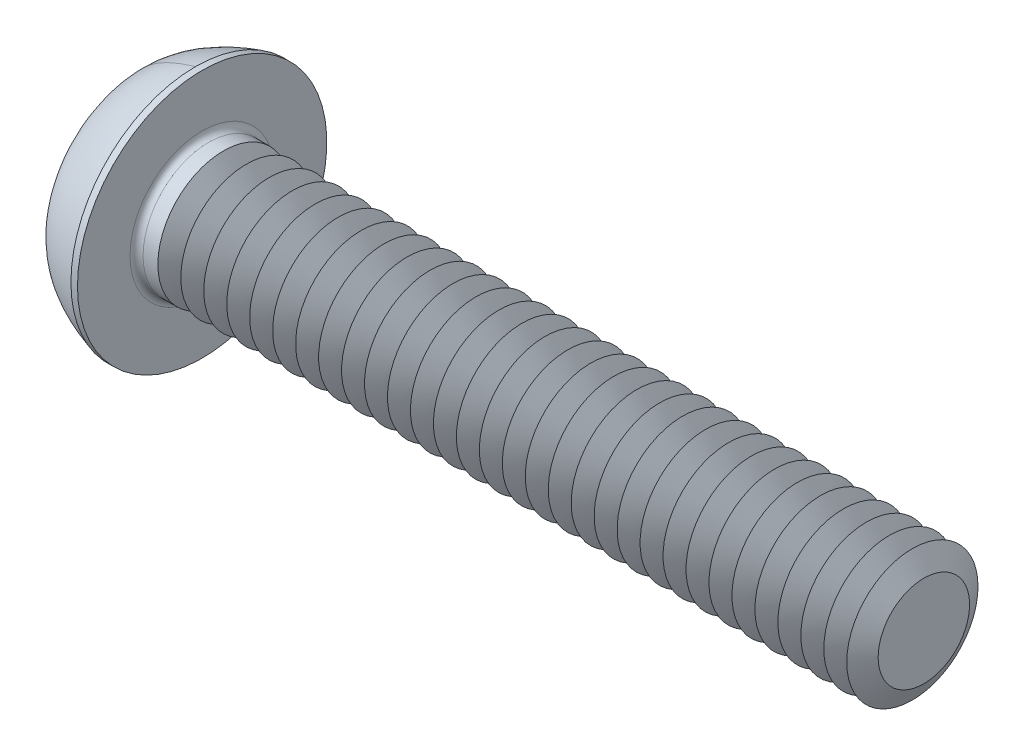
ISO-10303-21;
HEADER;
FILE_DESCRIPTION(('STEP AP214'),'2;1');
FILE_NAME('part.step','',(''),(''),'','','');
FILE_SCHEMA(('AUTOMOTIVE_DESIGN { 1 0 10303 214 1 1 1 1 }'));
ENDSEC;
DATA;
#1=APPLICATION_CONTEXT('core data for automotive mechanical design processes');
#2=APPLICATION_PROTOCOL_DEFINITION('international standard','automotive_design',2000,#1);
#3=PRODUCT_CONTEXT('',#1,'mechanical');
#4=PRODUCT('Part','Part','',(#3));
#5=PRODUCT_RELATED_PRODUCT_CATEGORY('part','',(#4));
#6=PRODUCT_DEFINITION_FORMATION('','',#4);
#7=PRODUCT_DEFINITION_CONTEXT('part definition',#1,'design');
#8=PRODUCT_DEFINITION('design','',#6,#7);
#9=PRODUCT_DEFINITION_SHAPE('','',#8);
#10=(LENGTH_UNIT() NAMED_UNIT(*) SI_UNIT(.MILLI.,.METRE.));
#11=(NAMED_UNIT(*) PLANE_ANGLE_UNIT() SI_UNIT($,.RADIAN.));
#12=(NAMED_UNIT(*) SI_UNIT($,.STERADIAN.) SOLID_ANGLE_UNIT());
#13=UNCERTAINTY_MEASURE_WITH_UNIT(LENGTH_MEASURE(1.E-05),#10,'distance_accuracy_value','');
#14=(GEOMETRIC_REPRESENTATION_CONTEXT(3) GLOBAL_UNCERTAINTY_ASSIGNED_CONTEXT((#13)) GLOBAL_UNIT_ASSIGNED_CONTEXT((#10,
#11,#12)) REPRESENTATION_CONTEXT('',''));
#15=CARTESIAN_POINT('',(0.,0.,0.));
#16=DIRECTION('',(0.,0.,1.));
#17=DIRECTION('',(1.,0.,0.));
#18=AXIS2_PLACEMENT_3D('',#15,#16,#17);
#19=CARTESIAN_POINT('',(0.,2.,0.));
#20=DIRECTION('',(-1.,0.,0.));
#21=DIRECTION('',(0.,0.,1.));
#22=AXIS2_PLACEMENT_3D('',#19,#20,#21);
#23=PLANE('',#22);
#24=CARTESIAN_POINT('',(0.,0.,0.));
#25=DIRECTION('',(-1.,0.,0.));
#26=DIRECTION('',(0.,0.,1.));
#27=AXIS2_PLACEMENT_3D('',#24,#25,#26);
#28=CIRCLE('',#27,1.39378221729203);
#29=CARTESIAN_POINT('',(0.,0.,1.39378221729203));
#30=VERTEX_POINT('',#29);
#31=EDGE_CURVE('E290',#30,#30,#28,.T.);
#32=ORIENTED_EDGE('',*,*,#31,.F.);
#33=EDGE_LOOP('',(#32));
#34=FACE_BOUND('',#33,.T.);
#35=ADVANCED_FACE('F17',(#34),#23,.F.);
#36=CARTESIAN_POINT('',(-0.35000000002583,0.,0.));
#37=DIRECTION('',(-1.,0.,0.));
#38=DIRECTION('',(0.,0.,1.));
#39=AXIS2_PLACEMENT_3D('',#36,#37,#38);
#40=CONICAL_SURFACE('',#39,1.99999999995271,1.04719755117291);
#41=CARTESIAN_POINT('',(-0.35000000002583,0.,0.));
#42=DIRECTION('',(1.,0.,0.));
#43=DIRECTION('',(0.,0.,-1.));
#44=AXIS2_PLACEMENT_3D('',#41,#42,#43);
#45=CIRCLE('',#44,1.99999999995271);
#46=CARTESIAN_POINT('',(-0.35000000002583,0.,-1.99999999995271));
#47=VERTEX_POINT('',#46);
#48=EDGE_CURVE('E287',#47,#47,#45,.F.);
#49=ORIENTED_EDGE('',*,*,#48,.F.);
#50=EDGE_LOOP('',(#49));
#51=FACE_BOUND('',#50,.T.);
#52=ORIENTED_EDGE('',*,*,#31,.T.);
#53=EDGE_LOOP('',(#52));
#54=FACE_BOUND('',#53,.T.);
#55=ADVANCED_FACE('F1283',(#51,#54),#40,.T.);
#56=CARTESIAN_POINT('',(-0.35000000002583,0.,0.));
#57=DIRECTION('',(1.,0.,0.));
#58=DIRECTION('',(0.,0.,-1.));
#59=AXIS2_PLACEMENT_3D('',#56,#57,#58);
#60=CONICAL_SURFACE('',#59,1.99999999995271,1.04719755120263);
#61=ORIENTED_EDGE('',*,*,#48,.T.);
#62=EDGE_LOOP('',(#61));
#63=FACE_BOUND('',#62,.T.);
#64=CARTESIAN_POINT('',(-0.699999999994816,0.,0.));
#65=DIRECTION('',(-1.,0.,0.));
#66=DIRECTION('',(0.,0.,1.));
#67=AXIS2_PLACEMENT_3D('',#64,#65,#66);
#68=CIRCLE('',#67,1.39378221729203);
#69=CARTESIAN_POINT('',(-0.699999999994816,0.,1.39378221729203));
#70=VERTEX_POINT('',#69);
#71=EDGE_CURVE('E284',#70,#70,#68,.T.);
#72=ORIENTED_EDGE('',*,*,#71,.F.);
#73=EDGE_LOOP('',(#72));
#74=FACE_BOUND('',#73,.T.);
#75=ADVANCED_FACE('F1274',(#63,#74),#60,.T.);
#76=CARTESIAN_POINT('',(-1.05000000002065,0.,0.));
#77=DIRECTION('',(-1.,0.,0.));
#78=DIRECTION('',(0.,0.,1.));
#79=AXIS2_PLACEMENT_3D('',#76,#77,#78);
#80=CONICAL_SURFACE('',#79,1.99999999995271,1.04719755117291);
#81=CARTESIAN_POINT('',(-1.05000000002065,0.,0.));
#82=DIRECTION('',(1.,0.,0.));
#83=DIRECTION('',(0.,0.,-1.));
#84=AXIS2_PLACEMENT_3D('',#81,#82,#83);
#85=CIRCLE('',#84,1.99999999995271);
#86=CARTESIAN_POINT('',(-1.05000000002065,0.,-1.99999999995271));
#87=VERTEX_POINT('',#86);
#88=EDGE_CURVE('E281',#87,#87,#85,.F.);
#89=ORIENTED_EDGE('',*,*,#88,.F.);
#90=EDGE_LOOP('',(#89));
#91=FACE_BOUND('',#90,.T.);
#92=ORIENTED_EDGE('',*,*,#71,.T.);
#93=EDGE_LOOP('',(#92));
#94=FACE_BOUND('',#93,.T.);
#95=ADVANCED_FACE('F1265',(#91,#94),#80,.T.);
#96=CARTESIAN_POINT('',(-1.05000000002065,0.,0.));
#97=DIRECTION('',(1.,0.,0.));
#98=DIRECTION('',(0.,0.,-1.));
#99=AXIS2_PLACEMENT_3D('',#96,#97,#98);
#100=CONICAL_SURFACE('',#99,1.99999999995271,1.04719755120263);
#101=ORIENTED_EDGE('',*,*,#88,.T.);
#102=EDGE_LOOP('',(#101));
#103=FACE_BOUND('',#102,.T.);
#104=CARTESIAN_POINT('',(-1.39999999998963,0.,0.));
#105=DIRECTION('',(-1.,0.,0.));
#106=DIRECTION('',(0.,0.,1.));
#107=AXIS2_PLACEMENT_3D('',#104,#105,#106);
#108=CIRCLE('',#107,1.39378221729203);
#109=CARTESIAN_POINT('',(-1.39999999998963,0.,1.39378221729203));
#110=VERTEX_POINT('',#109);
#111=EDGE_CURVE('E278',#110,#110,#108,.T.);
#112=ORIENTED_EDGE('',*,*,#111,.F.);
#113=EDGE_LOOP('',(#112));
#114=FACE_BOUND('',#113,.T.);
#115=ADVANCED_FACE('F1256',(#103,#114),#100,.T.);
#116=CARTESIAN_POINT('',(-1.75000000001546,0.,0.));
#117=DIRECTION('',(-1.,0.,0.));
#118=DIRECTION('',(0.,0.,1.));
#119=AXIS2_PLACEMENT_3D('',#116,#117,#118);
#120=CONICAL_SURFACE('',#119,1.99999999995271,1.04719755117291);
#121=CARTESIAN_POINT('',(-1.75000000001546,0.,0.));
#122=DIRECTION('',(1.,0.,0.));
#123=DIRECTION('',(0.,0.,-1.));
#124=AXIS2_PLACEMENT_3D('',#121,#122,#123);
#125=CIRCLE('',#124,1.99999999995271);
#126=CARTESIAN_POINT('',(-1.75000000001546,0.,-1.99999999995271));
#127=VERTEX_POINT('',#126);
#128=EDGE_CURVE('E275',#127,#127,#125,.F.);
#129=ORIENTED_EDGE('',*,*,#128,.F.);
#130=EDGE_LOOP('',(#129));
#131=FACE_BOUND('',#130,.T.);
#132=ORIENTED_EDGE('',*,*,#111,.T.);
#133=EDGE_LOOP('',(#132));
#134=FACE_BOUND('',#133,.T.);
#135=ADVANCED_FACE('F1247',(#131,#134),#120,.T.);
#136=CARTESIAN_POINT('',(-1.75000000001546,0.,0.));
#137=DIRECTION('',(1.,0.,0.));
#138=DIRECTION('',(0.,0.,-1.));
#139=AXIS2_PLACEMENT_3D('',#136,#137,#138);
#140=CONICAL_SURFACE('',#139,1.99999999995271,1.04719755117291);
#141=ORIENTED_EDGE('',*,*,#128,.T.);
#142=EDGE_LOOP('',(#141));
#143=FACE_BOUND('',#142,.T.);
#144=CARTESIAN_POINT('',(-2.10000000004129,0.,0.));
#145=DIRECTION('',(-1.,0.,0.));
#146=DIRECTION('',(0.,0.,1.));
#147=AXIS2_PLACEMENT_3D('',#144,#145,#146);
#148=CIRCLE('',#147,1.39378221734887);
#149=CARTESIAN_POINT('',(-2.10000000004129,0.,1.39378221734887));
#150=VERTEX_POINT('',#149);
#151=EDGE_CURVE('E272',#150,#150,#148,.T.);
#152=ORIENTED_EDGE('',*,*,#151,.F.);
#153=EDGE_LOOP('',(#152));
#154=FACE_BOUND('',#153,.T.);
#155=ADVANCED_FACE('F1238',(#143,#154),#140,.T.);
#156=CARTESIAN_POINT('',(-2.45000000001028,0.,0.));
#157=DIRECTION('',(-1.,0.,0.));
#158=DIRECTION('',(0.,0.,1.));
#159=AXIS2_PLACEMENT_3D('',#156,#157,#158);
#160=CONICAL_SURFACE('',#159,1.99999999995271,1.04719755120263);
#161=CARTESIAN_POINT('',(-2.45000000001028,0.,0.));
#162=DIRECTION('',(1.,0.,0.));
#163=DIRECTION('',(0.,0.,-1.));
#164=AXIS2_PLACEMENT_3D('',#161,#162,#163);
#165=CIRCLE('',#164,1.99999999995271);
#166=CARTESIAN_POINT('',(-2.45000000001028,0.,-1.99999999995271));
#167=VERTEX_POINT('',#166);
#168=EDGE_CURVE('E269',#167,#167,#165,.F.);
#169=ORIENTED_EDGE('',*,*,#168,.F.);
#170=EDGE_LOOP('',(#169));
#171=FACE_BOUND('',#170,.T.);
#172=ORIENTED_EDGE('',*,*,#151,.T.);
#173=EDGE_LOOP('',(#172));
#174=FACE_BOUND('',#173,.T.);
#175=ADVANCED_FACE('F1229',(#171,#174),#160,.T.);
#176=CARTESIAN_POINT('',(-2.45000000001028,0.,0.));
#177=DIRECTION('',(1.,0.,0.));
#178=DIRECTION('',(0.,0.,-1.));
#179=AXIS2_PLACEMENT_3D('',#176,#177,#178);
#180=CONICAL_SURFACE('',#179,1.99999999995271,1.04719755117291);
#181=ORIENTED_EDGE('',*,*,#168,.T.);
#182=EDGE_LOOP('',(#181));
#183=FACE_BOUND('',#182,.T.);
#184=CARTESIAN_POINT('',(-2.80000000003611,0.,0.));
#185=DIRECTION('',(-1.,0.,0.));
#186=DIRECTION('',(0.,0.,1.));
#187=AXIS2_PLACEMENT_3D('',#184,#185,#186);
#188=CIRCLE('',#187,1.39378221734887);
#189=CARTESIAN_POINT('',(-2.80000000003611,0.,1.39378221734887));
#190=VERTEX_POINT('',#189);
#191=EDGE_CURVE('E266',#190,#190,#188,.T.);
#192=ORIENTED_EDGE('',*,*,#191,.F.);
#193=EDGE_LOOP('',(#192));
#194=FACE_BOUND('',#193,.T.);
#195=ADVANCED_FACE('F1220',(#183,#194),#180,.T.);
#196=CARTESIAN_POINT('',(-3.14999999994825,0.,0.));
#197=DIRECTION('',(-1.,0.,0.));
#198=DIRECTION('',(0.,0.,1.));
#199=AXIS2_PLACEMENT_3D('',#196,#197,#198);
#200=CONICAL_SURFACE('',#199,1.99999999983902,1.04719755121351);
#201=CARTESIAN_POINT('',(-3.15000000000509,0.,0.));
#202=DIRECTION('',(1.,0.,0.));
#203=DIRECTION('',(0.,0.,-1.));
#204=AXIS2_PLACEMENT_3D('',#201,#202,#203);
#205=CIRCLE('',#204,1.99999999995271);
#206=CARTESIAN_POINT('',(-3.15000000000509,0.,-1.99999999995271));
#207=VERTEX_POINT('',#206);
#208=EDGE_CURVE('E263',#207,#207,#205,.F.);
#209=ORIENTED_EDGE('',*,*,#208,.F.);
#210=EDGE_LOOP('',(#209));
#211=FACE_BOUND('',#210,.T.);
#212=ORIENTED_EDGE('',*,*,#191,.T.);
#213=EDGE_LOOP('',(#212));
#214=FACE_BOUND('',#213,.T.);
#215=ADVANCED_FACE('F1211',(#211,#214),#200,.T.);
#216=CARTESIAN_POINT('',(-3.15000000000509,0.,0.));
#217=DIRECTION('',(1.,0.,0.));
#218=DIRECTION('',(0.,1.,0.));
#219=AXIS2_PLACEMENT_3D('',#216,#217,#218);
#220=CONICAL_SURFACE('',#219,1.99999999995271,1.04719755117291);
#221=ORIENTED_EDGE('',*,*,#208,.T.);
#222=EDGE_LOOP('',(#221));
#223=FACE_BOUND('',#222,.T.);
#224=CARTESIAN_POINT('',(-3.50000000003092,0.,0.));
#225=DIRECTION('',(-1.,0.,0.));
#226=DIRECTION('',(0.,0.,1.));
#227=AXIS2_PLACEMENT_3D('',#224,#225,#226);
#228=CIRCLE('',#227,1.39378221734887);
#229=CARTESIAN_POINT('',(-3.50000000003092,0.,1.39378221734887));
#230=VERTEX_POINT('',#229);
#231=EDGE_CURVE('E260',#230,#230,#228,.T.);
#232=ORIENTED_EDGE('',*,*,#231,.F.);
#233=EDGE_LOOP('',(#232));
#234=FACE_BOUND('',#233,.T.);
#235=ADVANCED_FACE('F1202',(#223,#234),#220,.T.);
#236=CARTESIAN_POINT('',(-3.84999999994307,0.,0.));
#237=DIRECTION('',(-1.,0.,0.));
#238=DIRECTION('',(0.,-1.,0.));
#239=AXIS2_PLACEMENT_3D('',#236,#237,#238);
#240=CONICAL_SURFACE('',#239,1.99999999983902,1.04719755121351);
#241=CARTESIAN_POINT('',(-3.84999999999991,0.,0.));
#242=DIRECTION('',(1.,0.,0.));
#243=DIRECTION('',(0.,0.,-1.));
#244=AXIS2_PLACEMENT_3D('',#241,#242,#243);
#245=CIRCLE('',#244,2.00000000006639);
#246=CARTESIAN_POINT('',(-3.84999999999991,0.,-2.00000000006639));
#247=VERTEX_POINT('',#246);
#248=EDGE_CURVE('E257',#247,#247,#245,.F.);
#249=ORIENTED_EDGE('',*,*,#248,.F.);
#250=EDGE_LOOP('',(#249));
#251=FACE_BOUND('',#250,.T.);
#252=ORIENTED_EDGE('',*,*,#231,.T.);
#253=EDGE_LOOP('',(#252));
#254=FACE_BOUND('',#253,.T.);
#255=ADVANCED_FACE('F1193',(#251,#254),#240,.T.);
#256=CARTESIAN_POINT('',(-3.85000000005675,0.,0.));
#257=DIRECTION('',(1.,0.,0.));
#258=DIRECTION('',(0.,0.,-1.));
#259=AXIS2_PLACEMENT_3D('',#256,#257,#258);
#260=CONICAL_SURFACE('',#259,1.99999999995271,1.04719755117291);
#261=ORIENTED_EDGE('',*,*,#248,.T.);
#262=EDGE_LOOP('',(#261));
#263=FACE_BOUND('',#262,.T.);
#264=CARTESIAN_POINT('',(-4.20000000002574,0.,0.));
#265=DIRECTION('',(-1.,0.,0.));
#266=DIRECTION('',(0.,0.,1.));
#267=AXIS2_PLACEMENT_3D('',#264,#265,#266);
#268=CIRCLE('',#267,1.39378221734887);
#269=CARTESIAN_POINT('',(-4.20000000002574,0.,1.39378221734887));
#270=VERTEX_POINT('',#269);
#271=EDGE_CURVE('E254',#270,#270,#268,.T.);
#272=ORIENTED_EDGE('',*,*,#271,.F.);
#273=EDGE_LOOP('',(#272));
#274=FACE_BOUND('',#273,.T.);
#275=ADVANCED_FACE('F1184',(#263,#274),#260,.T.);
#276=CARTESIAN_POINT('',(-4.54999999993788,0.,0.));
#277=DIRECTION('',(-1.,0.,0.));
#278=DIRECTION('',(0.,0.,1.));
#279=AXIS2_PLACEMENT_3D('',#276,#277,#278);
#280=CONICAL_SURFACE('',#279,1.99999999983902,1.04719755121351);
#281=CARTESIAN_POINT('',(-4.54999999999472,0.,0.));
#282=DIRECTION('',(1.,0.,0.));
#283=DIRECTION('',(0.,0.,-1.));
#284=AXIS2_PLACEMENT_3D('',#281,#282,#283);
#285=CIRCLE('',#284,2.00000000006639);
#286=CARTESIAN_POINT('',(-4.54999999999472,0.,-2.00000000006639));
#287=VERTEX_POINT('',#286);
#288=EDGE_CURVE('E251',#287,#287,#285,.F.);
#289=ORIENTED_EDGE('',*,*,#288,.F.);
#290=EDGE_LOOP('',(#289));
#291=FACE_BOUND('',#290,.T.);
#292=ORIENTED_EDGE('',*,*,#271,.T.);
#293=EDGE_LOOP('',(#292));
#294=FACE_BOUND('',#293,.T.);
#295=ADVANCED_FACE('F1175',(#291,#294),#280,.T.);
#296=CARTESIAN_POINT('',(-4.55000000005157,0.,0.));
#297=DIRECTION('',(1.,0.,0.));
#298=DIRECTION('',(0.,0.,-1.));
#299=AXIS2_PLACEMENT_3D('',#296,#297,#298);
#300=CONICAL_SURFACE('',#299,1.99999999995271,1.04719755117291);
#301=ORIENTED_EDGE('',*,*,#288,.T.);
#302=EDGE_LOOP('',(#301));
#303=FACE_BOUND('',#302,.T.);
#304=CARTESIAN_POINT('',(-4.90000000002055,0.,0.));
#305=DIRECTION('',(-1.,0.,0.));
#306=DIRECTION('',(0.,0.,1.));
#307=AXIS2_PLACEMENT_3D('',#304,#305,#306);
#308=CIRCLE('',#307,1.39378221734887);
#309=CARTESIAN_POINT('',(-4.90000000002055,0.,1.39378221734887));
#310=VERTEX_POINT('',#309);
#311=EDGE_CURVE('E248',#310,#310,#308,.T.);
#312=ORIENTED_EDGE('',*,*,#311,.F.);
#313=EDGE_LOOP('',(#312));
#314=FACE_BOUND('',#313,.T.);
#315=ADVANCED_FACE('F1166',(#303,#314),#300,.T.);
#316=CARTESIAN_POINT('',(-5.2499999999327,0.,0.));
#317=DIRECTION('',(-1.,0.,0.));
#318=DIRECTION('',(0.,0.,1.));
#319=AXIS2_PLACEMENT_3D('',#316,#317,#318);
#320=CONICAL_SURFACE('',#319,1.99999999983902,1.04719755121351);
#321=CARTESIAN_POINT('',(-5.24999999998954,0.,0.));
#322=DIRECTION('',(1.,0.,0.));
#323=DIRECTION('',(0.,0.,-1.));
#324=AXIS2_PLACEMENT_3D('',#321,#322,#323);
#325=CIRCLE('',#324,2.00000000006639);
#326=CARTESIAN_POINT('',(-5.24999999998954,0.,-2.00000000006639));
#327=VERTEX_POINT('',#326);
#328=EDGE_CURVE('E245',#327,#327,#325,.F.);
#329=ORIENTED_EDGE('',*,*,#328,.F.);
#330=EDGE_LOOP('',(#329));
#331=FACE_BOUND('',#330,.T.);
#332=ORIENTED_EDGE('',*,*,#311,.T.);
#333=EDGE_LOOP('',(#332));
#334=FACE_BOUND('',#333,.T.);
#335=ADVANCED_FACE('F1157',(#331,#334),#320,.T.);
#336=CARTESIAN_POINT('',(-5.25000000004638,0.,0.));
#337=DIRECTION('',(1.,0.,0.));
#338=DIRECTION('',(0.,0.,-1.));
#339=AXIS2_PLACEMENT_3D('',#336,#337,#338);
#340=CONICAL_SURFACE('',#339,1.99999999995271,1.04719755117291);
#341=ORIENTED_EDGE('',*,*,#328,.T.);
#342=EDGE_LOOP('',(#341));
#343=FACE_BOUND('',#342,.T.);
#344=CARTESIAN_POINT('',(-5.60000000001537,0.,0.));
#345=DIRECTION('',(-1.,0.,0.));
#346=DIRECTION('',(0.,0.,1.));
#347=AXIS2_PLACEMENT_3D('',#344,#345,#346);
#348=CIRCLE('',#347,1.39378221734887);
#349=CARTESIAN_POINT('',(-5.60000000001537,0.,1.39378221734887));
#350=VERTEX_POINT('',#349);
#351=EDGE_CURVE('E242',#350,#350,#348,.T.);
#352=ORIENTED_EDGE('',*,*,#351,.F.);
#353=EDGE_LOOP('',(#352));
#354=FACE_BOUND('',#353,.T.);
#355=ADVANCED_FACE('F1148',(#343,#354),#340,.T.);
#356=CARTESIAN_POINT('',(-5.94999999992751,0.,0.));
#357=DIRECTION('',(-1.,0.,0.));
#358=DIRECTION('',(0.,0.,1.));
#359=AXIS2_PLACEMENT_3D('',#356,#357,#358);
#360=CONICAL_SURFACE('',#359,1.99999999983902,1.04719755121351);
#361=CARTESIAN_POINT('',(-5.9500000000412,0.,0.));
#362=DIRECTION('',(1.,0.,0.));
#363=DIRECTION('',(0.,0.,-1.));
#364=AXIS2_PLACEMENT_3D('',#361,#362,#363);
#365=CIRCLE('',#364,1.99999999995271);
#366=CARTESIAN_POINT('',(-5.9500000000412,0.,-1.99999999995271));
#367=VERTEX_POINT('',#366);
#368=EDGE_CURVE('E239',#367,#367,#365,.F.);
#369=ORIENTED_EDGE('',*,*,#368,.F.);
#370=EDGE_LOOP('',(#369));
#371=FACE_BOUND('',#370,.T.);
#372=ORIENTED_EDGE('',*,*,#351,.T.);
#373=EDGE_LOOP('',(#372));
#374=FACE_BOUND('',#373,.T.);
#375=ADVANCED_FACE('F1139',(#371,#374),#360,.T.);
#376=CARTESIAN_POINT('',(-5.9500000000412,0.,0.));
#377=DIRECTION('',(1.,0.,0.));
#378=DIRECTION('',(0.,1.,0.));
#379=AXIS2_PLACEMENT_3D('',#376,#377,#378);
#380=CONICAL_SURFACE('',#379,1.99999999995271,1.04719755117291);
#381=ORIENTED_EDGE('',*,*,#368,.T.);
#382=EDGE_LOOP('',(#381));
#383=FACE_BOUND('',#382,.T.);
#384=CARTESIAN_POINT('',(-6.30000000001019,0.,0.));
#385=DIRECTION('',(-1.,0.,0.));
#386=DIRECTION('',(0.,0.,1.));
#387=AXIS2_PLACEMENT_3D('',#384,#385,#386);
#388=CIRCLE('',#387,1.39378221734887);
#389=CARTESIAN_POINT('',(-6.30000000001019,0.,1.39378221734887));
#390=VERTEX_POINT('',#389);
#391=EDGE_CURVE('E236',#390,#390,#388,.T.);
#392=ORIENTED_EDGE('',*,*,#391,.F.);
#393=EDGE_LOOP('',(#392));
#394=FACE_BOUND('',#393,.T.);
#395=ADVANCED_FACE('F1130',(#383,#394),#380,.T.);
#396=CARTESIAN_POINT('',(-6.64999999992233,0.,0.));
#397=DIRECTION('',(-1.,0.,0.));
#398=DIRECTION('',(0.,0.,1.));
#399=AXIS2_PLACEMENT_3D('',#396,#397,#398);
#400=CONICAL_SURFACE('',#399,1.99999999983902,1.04719755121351);
#401=CARTESIAN_POINT('',(-6.65000000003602,0.,0.));
#402=DIRECTION('',(1.,0.,0.));
#403=DIRECTION('',(0.,0.,-1.));
#404=AXIS2_PLACEMENT_3D('',#401,#402,#403);
#405=CIRCLE('',#404,1.99999999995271);
#406=CARTESIAN_POINT('',(-6.65000000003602,0.,-1.99999999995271));
#407=VERTEX_POINT('',#406);
#408=EDGE_CURVE('E233',#407,#407,#405,.F.);
#409=ORIENTED_EDGE('',*,*,#408,.F.);
#410=EDGE_LOOP('',(#409));
#411=FACE_BOUND('',#410,.T.);
#412=ORIENTED_EDGE('',*,*,#391,.T.);
#413=EDGE_LOOP('',(#412));
#414=FACE_BOUND('',#413,.T.);
#415=ADVANCED_FACE('F1121',(#411,#414),#400,.T.);
#416=CARTESIAN_POINT('',(-6.65000000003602,0.,0.));
#417=DIRECTION('',(1.,0.,0.));
#418=DIRECTION('',(0.,0.,-1.));
#419=AXIS2_PLACEMENT_3D('',#416,#417,#418);
#420=CONICAL_SURFACE('',#419,1.99999999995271,1.04719755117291);
#421=ORIENTED_EDGE('',*,*,#408,.T.);
#422=EDGE_LOOP('',(#421));
#423=FACE_BOUND('',#422,.T.);
#424=CARTESIAN_POINT('',(-7.000000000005,0.,0.));
#425=DIRECTION('',(-1.,0.,0.));
#426=DIRECTION('',(0.,0.,1.));
#427=AXIS2_PLACEMENT_3D('',#424,#425,#426);
#428=CIRCLE('',#427,1.39378221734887);
#429=CARTESIAN_POINT('',(-7.000000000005,0.,1.39378221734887));
#430=VERTEX_POINT('',#429);
#431=EDGE_CURVE('E230',#430,#430,#428,.T.);
#432=ORIENTED_EDGE('',*,*,#431,.F.);
#433=EDGE_LOOP('',(#432));
#434=FACE_BOUND('',#433,.T.);
#435=ADVANCED_FACE('F1112',(#423,#434),#420,.T.);
#436=CARTESIAN_POINT('',(-7.34999999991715,0.,0.));
#437=DIRECTION('',(-1.,0.,0.));
#438=DIRECTION('',(0.,-1.,0.));
#439=AXIS2_PLACEMENT_3D('',#436,#437,#438);
#440=CONICAL_SURFACE('',#439,1.99999999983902,1.04719755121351);
#441=CARTESIAN_POINT('',(-7.34999999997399,0.,0.));
#442=DIRECTION('',(1.,0.,0.));
#443=DIRECTION('',(0.,0.,-1.));
#444=AXIS2_PLACEMENT_3D('',#441,#442,#443);
#445=CIRCLE('',#444,2.00000000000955);
#446=CARTESIAN_POINT('',(-7.34999999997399,0.,-2.00000000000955));
#447=VERTEX_POINT('',#446);
#448=EDGE_CURVE('E227',#447,#447,#445,.F.);
#449=ORIENTED_EDGE('',*,*,#448,.F.);
#450=EDGE_LOOP('',(#449));
#451=FACE_BOUND('',#450,.T.);
#452=ORIENTED_EDGE('',*,*,#431,.T.);
#453=EDGE_LOOP('',(#452));
#454=FACE_BOUND('',#453,.T.);
#455=ADVANCED_FACE('F1103',(#451,#454),#440,.T.);
#456=CARTESIAN_POINT('',(-7.34999999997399,0.,0.));
#457=DIRECTION('',(1.,0.,0.));
#458=DIRECTION('',(0.,0.,-1.));
#459=AXIS2_PLACEMENT_3D('',#456,#457,#458);
#460=CONICAL_SURFACE('',#459,2.00000000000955,1.04719755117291);
#461=ORIENTED_EDGE('',*,*,#448,.T.);
#462=EDGE_LOOP('',(#461));
#463=FACE_BOUND('',#462,.T.);
#464=CARTESIAN_POINT('',(-7.70000000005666,0.,0.));
#465=DIRECTION('',(-1.,0.,0.));
#466=DIRECTION('',(0.,0.,1.));
#467=AXIS2_PLACEMENT_3D('',#464,#465,#466);
#468=CIRCLE('',#467,1.39378221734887);
#469=CARTESIAN_POINT('',(-7.70000000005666,0.,1.39378221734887));
#470=VERTEX_POINT('',#469);
#471=EDGE_CURVE('E224',#470,#470,#468,.T.);
#472=ORIENTED_EDGE('',*,*,#471,.F.);
#473=EDGE_LOOP('',(#472));
#474=FACE_BOUND('',#473,.T.);
#475=ADVANCED_FACE('F1094',(#463,#474),#460,.T.);
#476=CARTESIAN_POINT('',(-8.0499999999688,0.,0.));
#477=DIRECTION('',(-1.,0.,0.));
#478=DIRECTION('',(0.,0.,1.));
#479=AXIS2_PLACEMENT_3D('',#476,#477,#478);
#480=CONICAL_SURFACE('',#479,1.99999999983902,1.04719755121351);
#481=CARTESIAN_POINT('',(-8.05000000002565,0.,0.));
#482=DIRECTION('',(1.,0.,0.));
#483=DIRECTION('',(0.,0.,-1.));
#484=AXIS2_PLACEMENT_3D('',#481,#482,#483);
#485=CIRCLE('',#484,1.99999999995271);
#486=CARTESIAN_POINT('',(-8.05000000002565,0.,-1.99999999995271));
#487=VERTEX_POINT('',#486);
#488=EDGE_CURVE('E221',#487,#487,#485,.F.);
#489=ORIENTED_EDGE('',*,*,#488,.F.);
#490=EDGE_LOOP('',(#489));
#491=FACE_BOUND('',#490,.T.);
#492=ORIENTED_EDGE('',*,*,#471,.T.);
#493=EDGE_LOOP('',(#492));
#494=FACE_BOUND('',#493,.T.);
#495=ADVANCED_FACE('F1085',(#491,#494),#480,.T.);
#496=CARTESIAN_POINT('',(-8.05000000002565,0.,0.));
#497=DIRECTION('',(1.,0.,0.));
#498=DIRECTION('',(0.,0.,-1.));
#499=AXIS2_PLACEMENT_3D('',#496,#497,#498);
#500=CONICAL_SURFACE('',#499,1.99999999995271,1.04719755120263);
#501=ORIENTED_EDGE('',*,*,#488,.T.);
#502=EDGE_LOOP('',(#501));
#503=FACE_BOUND('',#502,.T.);
#504=CARTESIAN_POINT('',(-8.40000000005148,0.,0.));
#505=DIRECTION('',(-1.,0.,0.));
#506=DIRECTION('',(0.,0.,1.));
#507=AXIS2_PLACEMENT_3D('',#504,#505,#506);
#508=CIRCLE('',#507,1.39378221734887);
#509=CARTESIAN_POINT('',(-8.40000000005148,0.,1.39378221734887));
#510=VERTEX_POINT('',#509);
#511=EDGE_CURVE('E218',#510,#510,#508,.T.);
#512=ORIENTED_EDGE('',*,*,#511,.F.);
#513=EDGE_LOOP('',(#512));
#514=FACE_BOUND('',#513,.T.);
#515=ADVANCED_FACE('F1076',(#503,#514),#500,.T.);
#516=CARTESIAN_POINT('',(-8.74999999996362,0.,0.));
#517=DIRECTION('',(-1.,0.,0.));
#518=DIRECTION('',(0.,0.,1.));
#519=AXIS2_PLACEMENT_3D('',#516,#517,#518);
#520=CONICAL_SURFACE('',#519,1.99999999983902,1.04719755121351);
#521=CARTESIAN_POINT('',(-8.75000000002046,0.,0.));
#522=DIRECTION('',(1.,0.,0.));
#523=DIRECTION('',(0.,0.,-1.));
#524=AXIS2_PLACEMENT_3D('',#521,#522,#523);
#525=CIRCLE('',#524,1.99999999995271);
#526=CARTESIAN_POINT('',(-8.75000000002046,0.,-1.99999999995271));
#527=VERTEX_POINT('',#526);
#528=EDGE_CURVE('E215',#527,#527,#525,.F.);
#529=ORIENTED_EDGE('',*,*,#528,.F.);
#530=EDGE_LOOP('',(#529));
#531=FACE_BOUND('',#530,.T.);
#532=ORIENTED_EDGE('',*,*,#511,.T.);
#533=EDGE_LOOP('',(#532));
#534=FACE_BOUND('',#533,.T.);
#535=ADVANCED_FACE('F1067',(#531,#534),#520,.T.);
#536=CARTESIAN_POINT('',(-8.75000000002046,0.,0.));
#537=DIRECTION('',(1.,0.,0.));
#538=DIRECTION('',(0.,0.,-1.));
#539=AXIS2_PLACEMENT_3D('',#536,#537,#538);
#540=CONICAL_SURFACE('',#539,1.99999999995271,1.04719755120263);
#541=ORIENTED_EDGE('',*,*,#528,.T.);
#542=EDGE_LOOP('',(#541));
#543=FACE_BOUND('',#542,.T.);
#544=CARTESIAN_POINT('',(-9.09999999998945,0.,0.));
#545=DIRECTION('',(-1.,0.,0.));
#546=DIRECTION('',(0.,0.,1.));
#547=AXIS2_PLACEMENT_3D('',#544,#545,#546);
#548=CIRCLE('',#547,1.39378221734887);
#549=CARTESIAN_POINT('',(-9.09999999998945,0.,1.39378221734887));
#550=VERTEX_POINT('',#549);
#551=EDGE_CURVE('E212',#550,#550,#548,.T.);
#552=ORIENTED_EDGE('',*,*,#551,.F.);
#553=EDGE_LOOP('',(#552));
#554=FACE_BOUND('',#553,.T.);
#555=ADVANCED_FACE('F1058',(#543,#554),#540,.T.);
#556=CARTESIAN_POINT('',(-9.45000000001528,0.,0.));
#557=DIRECTION('',(-1.,0.,0.));
#558=DIRECTION('',(0.,0.,1.));
#559=AXIS2_PLACEMENT_3D('',#556,#557,#558);
#560=CONICAL_SURFACE('',#559,2.00000000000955,1.04719755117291);
#561=CARTESIAN_POINT('',(-9.45000000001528,0.,0.));
#562=DIRECTION('',(1.,0.,0.));
#563=DIRECTION('',(0.,0.,-1.));
#564=AXIS2_PLACEMENT_3D('',#561,#562,#563);
#565=CIRCLE('',#564,1.99999999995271);
#566=CARTESIAN_POINT('',(-9.45000000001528,0.,-1.99999999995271));
#567=VERTEX_POINT('',#566);
#568=EDGE_CURVE('E209',#567,#567,#565,.F.);
#569=ORIENTED_EDGE('',*,*,#568,.F.);
#570=EDGE_LOOP('',(#569));
#571=FACE_BOUND('',#570,.T.);
#572=ORIENTED_EDGE('',*,*,#551,.T.);
#573=EDGE_LOOP('',(#572));
#574=FACE_BOUND('',#573,.T.);
#575=ADVANCED_FACE('F1049',(#571,#574),#560,.T.);
#576=CARTESIAN_POINT('',(-9.45000000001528,0.,0.));
#577=DIRECTION('',(1.,0.,0.));
#578=DIRECTION('',(0.,0.,-1.));
#579=AXIS2_PLACEMENT_3D('',#576,#577,#578);
#580=CONICAL_SURFACE('',#579,1.99999999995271,1.04719755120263);
#581=ORIENTED_EDGE('',*,*,#568,.T.);
#582=EDGE_LOOP('',(#581));
#583=FACE_BOUND('',#582,.T.);
#584=CARTESIAN_POINT('',(-9.79999999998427,0.,0.));
#585=DIRECTION('',(-1.,0.,0.));
#586=DIRECTION('',(0.,0.,1.));
#587=AXIS2_PLACEMENT_3D('',#584,#585,#586);
#588=CIRCLE('',#587,1.39378221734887);
#589=CARTESIAN_POINT('',(-9.79999999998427,0.,1.39378221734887));
#590=VERTEX_POINT('',#589);
#591=EDGE_CURVE('E206',#590,#590,#588,.T.);
#592=ORIENTED_EDGE('',*,*,#591,.F.);
#593=EDGE_LOOP('',(#592));
#594=FACE_BOUND('',#593,.T.);
#595=ADVANCED_FACE('F1040',(#583,#594),#580,.T.);
#596=CARTESIAN_POINT('',(-10.1500000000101,0.,0.));
#597=DIRECTION('',(-1.,0.,0.));
#598=DIRECTION('',(0.,0.,1.));
#599=AXIS2_PLACEMENT_3D('',#596,#597,#598);
#600=CONICAL_SURFACE('',#599,2.00000000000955,1.04719755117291);
#601=CARTESIAN_POINT('',(-10.1500000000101,0.,0.));
#602=DIRECTION('',(1.,0.,0.));
#603=DIRECTION('',(0.,0.,-1.));
#604=AXIS2_PLACEMENT_3D('',#601,#602,#603);
#605=CIRCLE('',#604,1.99999999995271);
#606=CARTESIAN_POINT('',(-10.1500000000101,0.,-1.99999999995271));
#607=VERTEX_POINT('',#606);
#608=EDGE_CURVE('E203',#607,#607,#605,.F.);
#609=ORIENTED_EDGE('',*,*,#608,.F.);
#610=EDGE_LOOP('',(#609));
#611=FACE_BOUND('',#610,.T.);
#612=ORIENTED_EDGE('',*,*,#591,.T.);
#613=EDGE_LOOP('',(#612));
#614=FACE_BOUND('',#613,.T.);
#615=ADVANCED_FACE('F1031',(#611,#614),#600,.T.);
#616=CARTESIAN_POINT('',(-10.1500000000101,0.,0.));
#617=DIRECTION('',(1.,0.,0.));
#618=DIRECTION('',(0.,0.,-1.));
#619=AXIS2_PLACEMENT_3D('',#616,#617,#618);
#620=CONICAL_SURFACE('',#619,1.99999999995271,1.04719755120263);
#621=ORIENTED_EDGE('',*,*,#608,.T.);
#622=EDGE_LOOP('',(#621));
#623=FACE_BOUND('',#622,.T.);
#624=CARTESIAN_POINT('',(-10.4999999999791,0.,0.));
#625=DIRECTION('',(-1.,0.,0.));
#626=DIRECTION('',(0.,0.,1.));
#627=AXIS2_PLACEMENT_3D('',#624,#625,#626);
#628=CIRCLE('',#627,1.39378221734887);
#629=CARTESIAN_POINT('',(-10.4999999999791,0.,1.39378221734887));
#630=VERTEX_POINT('',#629);
#631=EDGE_CURVE('E200',#630,#630,#628,.T.);
#632=ORIENTED_EDGE('',*,*,#631,.F.);
#633=EDGE_LOOP('',(#632));
#634=FACE_BOUND('',#633,.T.);
#635=ADVANCED_FACE('F1022',(#623,#634),#620,.T.);
#636=CARTESIAN_POINT('',(-10.8500000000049,0.,0.));
#637=DIRECTION('',(-1.,0.,0.));
#638=DIRECTION('',(0.,0.,1.));
#639=AXIS2_PLACEMENT_3D('',#636,#637,#638);
#640=CONICAL_SURFACE('',#639,2.00000000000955,1.04719755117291);
#641=CARTESIAN_POINT('',(-10.8500000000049,0.,0.));
#642=DIRECTION('',(1.,0.,0.));
#643=DIRECTION('',(0.,0.,-1.));
#644=AXIS2_PLACEMENT_3D('',#641,#642,#643);
#645=CIRCLE('',#644,1.99999999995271);
#646=CARTESIAN_POINT('',(-10.8500000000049,0.,-1.99999999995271));
#647=VERTEX_POINT('',#646);
#648=EDGE_CURVE('E197',#647,#647,#645,.F.);
#649=ORIENTED_EDGE('',*,*,#648,.F.);
#650=EDGE_LOOP('',(#649));
#651=FACE_BOUND('',#650,.T.);
#652=ORIENTED_EDGE('',*,*,#631,.T.);
#653=EDGE_LOOP('',(#652));
#654=FACE_BOUND('',#653,.T.);
#655=ADVANCED_FACE('F1013',(#651,#654),#640,.T.);
#656=CARTESIAN_POINT('',(-10.8500000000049,0.,0.));
#657=DIRECTION('',(1.,0.,0.));
#658=DIRECTION('',(0.,0.,-1.));
#659=AXIS2_PLACEMENT_3D('',#656,#657,#658);
#660=CONICAL_SURFACE('',#659,1.99999999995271,1.04719755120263);
#661=ORIENTED_EDGE('',*,*,#648,.T.);
#662=EDGE_LOOP('',(#661));
#663=FACE_BOUND('',#662,.T.);
#664=CARTESIAN_POINT('',(-11.1999999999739,0.,0.));
#665=DIRECTION('',(-1.,0.,0.));
#666=DIRECTION('',(0.,0.,1.));
#667=AXIS2_PLACEMENT_3D('',#664,#665,#666);
#668=CIRCLE('',#667,1.39378221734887);
#669=CARTESIAN_POINT('',(-11.1999999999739,0.,1.39378221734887));
#670=VERTEX_POINT('',#669);
#671=EDGE_CURVE('E194',#670,#670,#668,.T.);
#672=ORIENTED_EDGE('',*,*,#671,.F.);
#673=EDGE_LOOP('',(#672));
#674=FACE_BOUND('',#673,.T.);
#675=ADVANCED_FACE('F1004',(#663,#674),#660,.T.);
#676=CARTESIAN_POINT('',(-11.5499999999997,0.,0.));
#677=DIRECTION('',(-1.,0.,0.));
#678=DIRECTION('',(0.,0.,1.));
#679=AXIS2_PLACEMENT_3D('',#676,#677,#678);
#680=CONICAL_SURFACE('',#679,2.00000000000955,1.04719755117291);
#681=CARTESIAN_POINT('',(-11.5499999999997,0.,0.));
#682=DIRECTION('',(1.,0.,0.));
#683=DIRECTION('',(0.,0.,-1.));
#684=AXIS2_PLACEMENT_3D('',#681,#682,#683);
#685=CIRCLE('',#684,2.00000000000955);
#686=CARTESIAN_POINT('',(-11.5499999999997,0.,-2.00000000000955));
#687=VERTEX_POINT('',#686);
#688=EDGE_CURVE('E191',#687,#687,#685,.F.);
#689=ORIENTED_EDGE('',*,*,#688,.F.);
#690=EDGE_LOOP('',(#689));
#691=FACE_BOUND('',#690,.T.);
#692=ORIENTED_EDGE('',*,*,#671,.T.);
#693=EDGE_LOOP('',(#692));
#694=FACE_BOUND('',#693,.T.);
#695=ADVANCED_FACE('F995',(#691,#694),#680,.T.);
#696=CARTESIAN_POINT('',(-11.5499999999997,0.,0.));
#697=DIRECTION('',(1.,0.,0.));
#698=DIRECTION('',(0.,0.,-1.));
#699=AXIS2_PLACEMENT_3D('',#696,#697,#698);
#700=CONICAL_SURFACE('',#699,2.00000000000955,1.04719755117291);
#701=ORIENTED_EDGE('',*,*,#688,.T.);
#702=EDGE_LOOP('',(#701));
#703=FACE_BOUND('',#702,.T.);
#704=CARTESIAN_POINT('',(-11.8999999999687,0.,0.));
#705=DIRECTION('',(-1.,0.,0.));
#706=DIRECTION('',(0.,0.,1.));
#707=AXIS2_PLACEMENT_3D('',#704,#705,#706);
#708=CIRCLE('',#707,1.39378221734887);
#709=CARTESIAN_POINT('',(-11.8999999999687,0.,1.39378221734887));
#710=VERTEX_POINT('',#709);
#711=EDGE_CURVE('E188',#710,#710,#708,.T.);
#712=ORIENTED_EDGE('',*,*,#711,.F.);
#713=EDGE_LOOP('',(#712));
#714=FACE_BOUND('',#713,.T.);
#715=ADVANCED_FACE('F986',(#703,#714),#700,.T.);
#716=CARTESIAN_POINT('',(-12.2499999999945,0.,0.));
#717=DIRECTION('',(-1.,0.,0.));
#718=DIRECTION('',(0.,0.,1.));
#719=AXIS2_PLACEMENT_3D('',#716,#717,#718);
#720=CONICAL_SURFACE('',#719,2.00000000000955,1.04719755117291);
#721=CARTESIAN_POINT('',(-12.2499999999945,0.,0.));
#722=DIRECTION('',(1.,0.,0.));
#723=DIRECTION('',(0.,0.,-1.));
#724=AXIS2_PLACEMENT_3D('',#721,#722,#723);
#725=CIRCLE('',#724,2.00000000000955);
#726=CARTESIAN_POINT('',(-12.2499999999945,0.,-2.00000000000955));
#727=VERTEX_POINT('',#726);
#728=EDGE_CURVE('E185',#727,#727,#725,.F.);
#729=ORIENTED_EDGE('',*,*,#728,.F.);
#730=EDGE_LOOP('',(#729));
#731=FACE_BOUND('',#730,.T.);
#732=ORIENTED_EDGE('',*,*,#711,.T.);
#733=EDGE_LOOP('',(#732));
#734=FACE_BOUND('',#733,.T.);
#735=ADVANCED_FACE('F977',(#731,#734),#720,.T.);
#736=CARTESIAN_POINT('',(-12.2499999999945,0.,0.));
#737=DIRECTION('',(1.,0.,0.));
#738=DIRECTION('',(0.,0.,-1.));
#739=AXIS2_PLACEMENT_3D('',#736,#737,#738);
#740=CONICAL_SURFACE('',#739,2.00000000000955,1.04719755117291);
#741=ORIENTED_EDGE('',*,*,#728,.T.);
#742=EDGE_LOOP('',(#741));
#743=FACE_BOUND('',#742,.T.);
#744=CARTESIAN_POINT('',(-12.5999999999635,0.,0.));
#745=DIRECTION('',(-1.,0.,0.));
#746=DIRECTION('',(0.,0.,1.));
#747=AXIS2_PLACEMENT_3D('',#744,#745,#746);
#748=CIRCLE('',#747,1.39378221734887);
#749=CARTESIAN_POINT('',(-12.5999999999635,0.,1.39378221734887));
#750=VERTEX_POINT('',#749);
#751=EDGE_CURVE('E182',#750,#750,#748,.T.);
#752=ORIENTED_EDGE('',*,*,#751,.F.);
#753=EDGE_LOOP('',(#752));
#754=FACE_BOUND('',#753,.T.);
#755=ADVANCED_FACE('F968',(#743,#754),#740,.T.);
#756=CARTESIAN_POINT('',(-12.9499999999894,0.,0.));
#757=DIRECTION('',(-1.,0.,0.));
#758=DIRECTION('',(0.,-1.,0.));
#759=AXIS2_PLACEMENT_3D('',#756,#757,#758);
#760=CONICAL_SURFACE('',#759,2.00000000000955,1.04719755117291);
#761=CARTESIAN_POINT('',(-12.9499999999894,0.,0.));
#762=DIRECTION('',(1.,0.,0.));
#763=DIRECTION('',(0.,0.,-1.));
#764=AXIS2_PLACEMENT_3D('',#761,#762,#763);
#765=CIRCLE('',#764,2.00000000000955);
#766=CARTESIAN_POINT('',(-12.9499999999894,0.,-2.00000000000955));
#767=VERTEX_POINT('',#766);
#768=EDGE_CURVE('E179',#767,#767,#765,.F.);
#769=ORIENTED_EDGE('',*,*,#768,.F.);
#770=EDGE_LOOP('',(#769));
#771=FACE_BOUND('',#770,.T.);
#772=ORIENTED_EDGE('',*,*,#751,.T.);
#773=EDGE_LOOP('',(#772));
#774=FACE_BOUND('',#773,.T.);
#775=ADVANCED_FACE('F959',(#771,#774),#760,.T.);
#776=CARTESIAN_POINT('',(-12.9499999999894,0.,0.));
#777=DIRECTION('',(1.,0.,0.));
#778=DIRECTION('',(0.,1.,0.));
#779=AXIS2_PLACEMENT_3D('',#776,#777,#778);
#780=CONICAL_SURFACE('',#779,2.00000000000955,1.04719755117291);
#781=ORIENTED_EDGE('',*,*,#768,.T.);
#782=EDGE_LOOP('',(#781));
#783=FACE_BOUND('',#782,.T.);
#784=CARTESIAN_POINT('',(-13.2999999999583,0.,0.));
#785=DIRECTION('',(-1.,0.,0.));
#786=DIRECTION('',(0.,0.,1.));
#787=AXIS2_PLACEMENT_3D('',#784,#785,#786);
#788=CIRCLE('',#787,1.39378221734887);
#789=CARTESIAN_POINT('',(-13.2999999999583,0.,1.39378221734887));
#790=VERTEX_POINT('',#789);
#791=EDGE_CURVE('E176',#790,#790,#788,.T.);
#792=ORIENTED_EDGE('',*,*,#791,.F.);
#793=EDGE_LOOP('',(#792));
#794=FACE_BOUND('',#793,.T.);
#795=ADVANCED_FACE('F950',(#783,#794),#780,.T.);
#796=CARTESIAN_POINT('',(-13.6499999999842,0.,0.));
#797=DIRECTION('',(-1.,0.,0.));
#798=DIRECTION('',(0.,0.,1.));
#799=AXIS2_PLACEMENT_3D('',#796,#797,#798);
#800=CONICAL_SURFACE('',#799,2.00000000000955,1.04719755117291);
#801=CARTESIAN_POINT('',(-13.6499999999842,0.,0.));
#802=DIRECTION('',(1.,0.,0.));
#803=DIRECTION('',(0.,0.,-1.));
#804=AXIS2_PLACEMENT_3D('',#801,#802,#803);
#805=CIRCLE('',#804,2.00000000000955);
#806=CARTESIAN_POINT('',(-13.6499999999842,0.,-2.00000000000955));
#807=VERTEX_POINT('',#806);
#808=EDGE_CURVE('E173',#807,#807,#805,.F.);
#809=ORIENTED_EDGE('',*,*,#808,.F.);
#810=EDGE_LOOP('',(#809));
#811=FACE_BOUND('',#810,.T.);
#812=ORIENTED_EDGE('',*,*,#791,.T.);
#813=EDGE_LOOP('',(#812));
#814=FACE_BOUND('',#813,.T.);
#815=ADVANCED_FACE('F941',(#811,#814),#800,.T.);
#816=CARTESIAN_POINT('',(-13.6499999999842,0.,0.));
#817=DIRECTION('',(1.,0.,0.));
#818=DIRECTION('',(0.,0.,-1.));
#819=AXIS2_PLACEMENT_3D('',#816,#817,#818);
#820=CONICAL_SURFACE('',#819,2.00000000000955,1.04719755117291);
#821=ORIENTED_EDGE('',*,*,#808,.T.);
#822=EDGE_LOOP('',(#821));
#823=FACE_BOUND('',#822,.T.);
#824=CARTESIAN_POINT('',(-13.9999999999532,0.,0.));
#825=DIRECTION('',(-1.,0.,0.));
#826=DIRECTION('',(0.,0.,1.));
#827=AXIS2_PLACEMENT_3D('',#824,#825,#826);
#828=CIRCLE('',#827,1.39378221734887);
#829=CARTESIAN_POINT('',(-13.9999999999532,0.,1.39378221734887));
#830=VERTEX_POINT('',#829);
#831=EDGE_CURVE('E170',#830,#830,#828,.T.);
#832=ORIENTED_EDGE('',*,*,#831,.F.);
#833=EDGE_LOOP('',(#832));
#834=FACE_BOUND('',#833,.T.);
#835=ADVANCED_FACE('F932',(#823,#834),#820,.T.);
#836=CARTESIAN_POINT('',(-14.349999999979,0.,0.));
#837=DIRECTION('',(-1.,0.,0.));
#838=DIRECTION('',(0.,0.,1.));
#839=AXIS2_PLACEMENT_3D('',#836,#837,#838);
#840=CONICAL_SURFACE('',#839,2.00000000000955,1.04719755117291);
#841=CARTESIAN_POINT('',(-14.349999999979,0.,0.));
#842=DIRECTION('',(1.,0.,0.));
#843=DIRECTION('',(0.,0.,-1.));
#844=AXIS2_PLACEMENT_3D('',#841,#842,#843);
#845=CIRCLE('',#844,2.00000000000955);
#846=CARTESIAN_POINT('',(-14.349999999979,0.,-2.00000000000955));
#847=VERTEX_POINT('',#846);
#848=EDGE_CURVE('E167',#847,#847,#845,.F.);
#849=ORIENTED_EDGE('',*,*,#848,.F.);
#850=EDGE_LOOP('',(#849));
#851=FACE_BOUND('',#850,.T.);
#852=ORIENTED_EDGE('',*,*,#831,.T.);
#853=EDGE_LOOP('',(#852));
#854=FACE_BOUND('',#853,.T.);
#855=ADVANCED_FACE('F923',(#851,#854),#840,.T.);
#856=CARTESIAN_POINT('',(-14.349999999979,0.,0.));
#857=DIRECTION('',(1.,0.,0.));
#858=DIRECTION('',(0.,0.,-1.));
#859=AXIS2_PLACEMENT_3D('',#856,#857,#858);
#860=CONICAL_SURFACE('',#859,2.00000000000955,1.04719755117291);
#861=ORIENTED_EDGE('',*,*,#848,.T.);
#862=EDGE_LOOP('',(#861));
#863=FACE_BOUND('',#862,.T.);
#864=CARTESIAN_POINT('',(-14.699999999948,0.,0.));
#865=DIRECTION('',(-1.,0.,0.));
#866=DIRECTION('',(0.,0.,1.));
#867=AXIS2_PLACEMENT_3D('',#864,#865,#866);
#868=CIRCLE('',#867,1.39378221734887);
#869=CARTESIAN_POINT('',(-14.699999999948,0.,1.39378221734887));
#870=VERTEX_POINT('',#869);
#871=EDGE_CURVE('E164',#870,#870,#868,.T.);
#872=ORIENTED_EDGE('',*,*,#871,.F.);
#873=EDGE_LOOP('',(#872));
#874=FACE_BOUND('',#873,.T.);
#875=ADVANCED_FACE('F914',(#863,#874),#860,.T.);
#876=CARTESIAN_POINT('',(-15.0499999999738,0.,0.));
#877=DIRECTION('',(-1.,0.,0.));
#878=DIRECTION('',(0.,-1.,0.));
#879=AXIS2_PLACEMENT_3D('',#876,#877,#878);
#880=CONICAL_SURFACE('',#879,2.00000000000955,1.04719755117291);
#881=CARTESIAN_POINT('',(-15.0499999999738,0.,0.));
#882=DIRECTION('',(1.,0.,0.));
#883=DIRECTION('',(0.,0.,-1.));
#884=AXIS2_PLACEMENT_3D('',#881,#882,#883);
#885=CIRCLE('',#884,2.00000000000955);
#886=CARTESIAN_POINT('',(-15.0499999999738,0.,-2.00000000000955));
#887=VERTEX_POINT('',#886);
#888=EDGE_CURVE('E161',#887,#887,#885,.F.);
#889=ORIENTED_EDGE('',*,*,#888,.F.);
#890=EDGE_LOOP('',(#889));
#891=FACE_BOUND('',#890,.T.);
#892=ORIENTED_EDGE('',*,*,#871,.T.);
#893=EDGE_LOOP('',(#892));
#894=FACE_BOUND('',#893,.T.);
#895=ADVANCED_FACE('F905',(#891,#894),#880,.T.);
#896=CARTESIAN_POINT('',(-15.0500000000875,0.,0.));
#897=DIRECTION('',(1.,0.,0.));
#898=DIRECTION('',(0.,0.,-1.));
#899=AXIS2_PLACEMENT_3D('',#896,#897,#898);
#900=CONICAL_SURFACE('',#899,1.99999999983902,1.04719755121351);
#901=ORIENTED_EDGE('',*,*,#888,.T.);
#902=EDGE_LOOP('',(#901));
#903=FACE_BOUND('',#902,.T.);
#904=CARTESIAN_POINT('',(-15.3999999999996,0.,0.));
#905=DIRECTION('',(-1.,0.,0.));
#906=DIRECTION('',(0.,0.,1.));
#907=AXIS2_PLACEMENT_3D('',#904,#905,#906);
#908=CIRCLE('',#907,1.39378221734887);
#909=CARTESIAN_POINT('',(-15.3999999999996,0.,1.39378221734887));
#910=VERTEX_POINT('',#909);
#911=EDGE_CURVE('E158',#910,#910,#908,.T.);
#912=ORIENTED_EDGE('',*,*,#911,.F.);
#913=EDGE_LOOP('',(#912));
#914=FACE_BOUND('',#913,.T.);
#915=ADVANCED_FACE('F896',(#903,#914),#900,.T.);
#916=CARTESIAN_POINT('',(-15.7500000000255,0.,0.));
#917=DIRECTION('',(-1.,0.,0.));
#918=DIRECTION('',(0.,0.,1.));
#919=AXIS2_PLACEMENT_3D('',#916,#917,#918);
#920=CONICAL_SURFACE('',#919,2.00000000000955,1.04719755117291);
#921=CARTESIAN_POINT('',(-15.7499999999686,0.,0.));
#922=DIRECTION('',(1.,0.,0.));
#923=DIRECTION('',(0.,0.,-1.));
#924=AXIS2_PLACEMENT_3D('',#921,#922,#923);
#925=CIRCLE('',#924,2.00000000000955);
#926=CARTESIAN_POINT('',(-15.7499999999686,0.,-2.00000000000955));
#927=VERTEX_POINT('',#926);
#928=EDGE_CURVE('E155',#927,#927,#925,.F.);
#929=ORIENTED_EDGE('',*,*,#928,.F.);
#930=EDGE_LOOP('',(#929));
#931=FACE_BOUND('',#930,.T.);
#932=ORIENTED_EDGE('',*,*,#911,.T.);
#933=EDGE_LOOP('',(#932));
#934=FACE_BOUND('',#933,.T.);
#935=ADVANCED_FACE('F887',(#931,#934),#920,.T.);
#936=CARTESIAN_POINT('',(-15.7500000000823,0.,0.));
#937=DIRECTION('',(1.,0.,0.));
#938=DIRECTION('',(0.,0.,-1.));
#939=AXIS2_PLACEMENT_3D('',#936,#937,#938);
#940=CONICAL_SURFACE('',#939,1.99999999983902,1.04719755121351);
#941=ORIENTED_EDGE('',*,*,#928,.T.);
#942=EDGE_LOOP('',(#941));
#943=FACE_BOUND('',#942,.T.);
#944=CARTESIAN_POINT('',(-16.0999999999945,0.,0.));
#945=DIRECTION('',(-1.,0.,0.));
#946=DIRECTION('',(0.,0.,1.));
#947=AXIS2_PLACEMENT_3D('',#944,#945,#946);
#948=CIRCLE('',#947,1.39378221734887);
#949=CARTESIAN_POINT('',(-16.0999999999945,0.,1.39378221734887));
#950=VERTEX_POINT('',#949);
#951=EDGE_CURVE('E152',#950,#950,#948,.T.);
#952=ORIENTED_EDGE('',*,*,#951,.F.);
#953=EDGE_LOOP('',(#952));
#954=FACE_BOUND('',#953,.T.);
#955=ADVANCED_FACE('F878',(#943,#954),#940,.T.);
#956=CARTESIAN_POINT('',(-16.4500000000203,0.,0.));
#957=DIRECTION('',(-1.,0.,0.));
#958=DIRECTION('',(0.,0.,1.));
#959=AXIS2_PLACEMENT_3D('',#956,#957,#958);
#960=CONICAL_SURFACE('',#959,2.00000000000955,1.04719755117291);
#961=CARTESIAN_POINT('',(-16.4499999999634,0.,0.));
#962=DIRECTION('',(1.,0.,0.));
#963=DIRECTION('',(0.,0.,-1.));
#964=AXIS2_PLACEMENT_3D('',#961,#962,#963);
#965=CIRCLE('',#964,2.00000000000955);
#966=CARTESIAN_POINT('',(-16.4499999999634,0.,-2.00000000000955));
#967=VERTEX_POINT('',#966);
#968=EDGE_CURVE('E149',#967,#967,#965,.F.);
#969=ORIENTED_EDGE('',*,*,#968,.F.);
#970=EDGE_LOOP('',(#969));
#971=FACE_BOUND('',#970,.T.);
#972=ORIENTED_EDGE('',*,*,#951,.T.);
#973=EDGE_LOOP('',(#972));
#974=FACE_BOUND('',#973,.T.);
#975=ADVANCED_FACE('F869',(#971,#974),#960,.T.);
#976=CARTESIAN_POINT('',(-16.4500000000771,0.,0.));
#977=DIRECTION('',(1.,0.,0.));
#978=DIRECTION('',(0.,0.,-1.));
#979=AXIS2_PLACEMENT_3D('',#976,#977,#978);
#980=CONICAL_SURFACE('',#979,1.99999999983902,1.04719755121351);
#981=ORIENTED_EDGE('',*,*,#968,.T.);
#982=EDGE_LOOP('',(#981));
#983=FACE_BOUND('',#982,.T.);
#984=CARTESIAN_POINT('',(-16.7999999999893,0.,0.));
#985=DIRECTION('',(-1.,0.,0.));
#986=DIRECTION('',(0.,0.,1.));
#987=AXIS2_PLACEMENT_3D('',#984,#985,#986);
#988=CIRCLE('',#987,1.39378221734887);
#989=CARTESIAN_POINT('',(-16.7999999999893,0.,1.39378221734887));
#990=VERTEX_POINT('',#989);
#991=EDGE_CURVE('E146',#990,#990,#988,.T.);
#992=ORIENTED_EDGE('',*,*,#991,.F.);
#993=EDGE_LOOP('',(#992));
#994=FACE_BOUND('',#993,.T.);
#995=ADVANCED_FACE('F860',(#983,#994),#980,.T.);
#996=CARTESIAN_POINT('',(-17.1500000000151,0.,0.));
#997=DIRECTION('',(-1.,0.,0.));
#998=DIRECTION('',(0.,0.,1.));
#999=AXIS2_PLACEMENT_3D('',#996,#997,#998);
#1000=CONICAL_SURFACE('',#999,2.00000000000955,1.04719755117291);
#1001=CARTESIAN_POINT('',(-17.1499999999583,0.,0.));
#1002=DIRECTION('',(1.,0.,0.));
#1003=DIRECTION('',(0.,0.,-1.));
#1004=AXIS2_PLACEMENT_3D('',#1001,#1002,#1003);
#1005=CIRCLE('',#1004,2.00000000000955);
#1006=CARTESIAN_POINT('',(-17.1499999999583,0.,-2.00000000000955));
#1007=VERTEX_POINT('',#1006);
#1008=EDGE_CURVE('E143',#1007,#1007,#1005,.F.);
#1009=ORIENTED_EDGE('',*,*,#1008,.F.);
#1010=EDGE_LOOP('',(#1009));
#1011=FACE_BOUND('',#1010,.T.);
#1012=ORIENTED_EDGE('',*,*,#991,.T.);
#1013=EDGE_LOOP('',(#1012));
#1014=FACE_BOUND('',#1013,.T.);
#1015=ADVANCED_FACE('F851',(#1011,#1014),#1000,.T.);
#1016=CARTESIAN_POINT('',(-17.1500000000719,0.,0.));
#1017=DIRECTION('',(1.,0.,0.));
#1018=DIRECTION('',(0.,0.,-1.));
#1019=AXIS2_PLACEMENT_3D('',#1016,#1017,#1018);
#1020=CONICAL_SURFACE('',#1019,1.99999999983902,1.04719755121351);
#1021=ORIENTED_EDGE('',*,*,#1008,.T.);
#1022=EDGE_LOOP('',(#1021));
#1023=FACE_BOUND('',#1022,.T.);
#1024=CARTESIAN_POINT('',(-17.4999999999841,0.,0.));
#1025=DIRECTION('',(-1.,0.,0.));
#1026=DIRECTION('',(0.,0.,1.));
#1027=AXIS2_PLACEMENT_3D('',#1024,#1025,#1026);
#1028=CIRCLE('',#1027,1.39378221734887);
#1029=CARTESIAN_POINT('',(-17.4999999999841,0.,1.39378221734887));
#1030=VERTEX_POINT('',#1029);
#1031=EDGE_CURVE('E140',#1030,#1030,#1028,.T.);
#1032=ORIENTED_EDGE('',*,*,#1031,.F.);
#1033=EDGE_LOOP('',(#1032));
#1034=FACE_BOUND('',#1033,.T.);
#1035=ADVANCED_FACE('F842',(#1023,#1034),#1020,.T.);
#1036=CARTESIAN_POINT('',(-17.8500000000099,0.,0.));
#1037=DIRECTION('',(-1.,0.,0.));
#1038=DIRECTION('',(0.,0.,1.));
#1039=AXIS2_PLACEMENT_3D('',#1036,#1037,#1038);
#1040=CONICAL_SURFACE('',#1039,2.00000000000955,1.04719755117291);
#1041=CARTESIAN_POINT('',(-17.8499999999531,0.,0.));
#1042=DIRECTION('',(1.,0.,0.));
#1043=DIRECTION('',(0.,0.,-1.));
#1044=AXIS2_PLACEMENT_3D('',#1041,#1042,#1043);
#1045=CIRCLE('',#1044,2.00000000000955);
#1046=CARTESIAN_POINT('',(-17.8499999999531,0.,-2.00000000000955));
#1047=VERTEX_POINT('',#1046);
#1048=EDGE_CURVE('E137',#1047,#1047,#1045,.F.);
#1049=ORIENTED_EDGE('',*,*,#1048,.F.);
#1050=EDGE_LOOP('',(#1049));
#1051=FACE_BOUND('',#1050,.T.);
#1052=ORIENTED_EDGE('',*,*,#1031,.T.);
#1053=EDGE_LOOP('',(#1052));
#1054=FACE_BOUND('',#1053,.T.);
#1055=ADVANCED_FACE('F833',(#1051,#1054),#1040,.T.);
#1056=CARTESIAN_POINT('',(-17.8500000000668,0.,0.));
#1057=DIRECTION('',(1.,0.,0.));
#1058=DIRECTION('',(0.,0.,-1.));
#1059=AXIS2_PLACEMENT_3D('',#1056,#1057,#1058);
#1060=CONICAL_SURFACE('',#1059,1.99999999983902,1.04719755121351);
#1061=ORIENTED_EDGE('',*,*,#1048,.T.);
#1062=EDGE_LOOP('',(#1061));
#1063=FACE_BOUND('',#1062,.T.);
#1064=CARTESIAN_POINT('',(-18.1999999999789,0.,0.));
#1065=DIRECTION('',(-1.,0.,0.));
#1066=DIRECTION('',(0.,0.,1.));
#1067=AXIS2_PLACEMENT_3D('',#1064,#1065,#1066);
#1068=CIRCLE('',#1067,1.39378221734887);
#1069=CARTESIAN_POINT('',(-18.1999999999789,0.,1.39378221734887));
#1070=VERTEX_POINT('',#1069);
#1071=EDGE_CURVE('E134',#1070,#1070,#1068,.T.);
#1072=ORIENTED_EDGE('',*,*,#1071,.F.);
#1073=EDGE_LOOP('',(#1072));
#1074=FACE_BOUND('',#1073,.T.);
#1075=ADVANCED_FACE('F824',(#1063,#1074),#1060,.T.);
#1076=CARTESIAN_POINT('',(-18.5500000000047,0.,0.));
#1077=DIRECTION('',(-1.,0.,0.));
#1078=DIRECTION('',(0.,0.,1.));
#1079=AXIS2_PLACEMENT_3D('',#1076,#1077,#1078);
#1080=CONICAL_SURFACE('',#1079,2.00000000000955,1.04719755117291);
#1081=CARTESIAN_POINT('',(-18.5499999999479,0.,0.));
#1082=DIRECTION('',(1.,0.,0.));
#1083=DIRECTION('',(0.,0.,-1.));
#1084=AXIS2_PLACEMENT_3D('',#1081,#1082,#1083);
#1085=CIRCLE('',#1084,2.00000000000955);
#1086=CARTESIAN_POINT('',(-18.5499999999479,0.,-2.00000000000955));
#1087=VERTEX_POINT('',#1086);
#1088=EDGE_CURVE('E131',#1087,#1087,#1085,.F.);
#1089=ORIENTED_EDGE('',*,*,#1088,.F.);
#1090=EDGE_LOOP('',(#1089));
#1091=FACE_BOUND('',#1090,.T.);
#1092=ORIENTED_EDGE('',*,*,#1071,.T.);
#1093=EDGE_LOOP('',(#1092));
#1094=FACE_BOUND('',#1093,.T.);
#1095=ADVANCED_FACE('F815',(#1091,#1094),#1080,.T.);
#1096=CARTESIAN_POINT('',(-18.5500000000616,0.,0.));
#1097=DIRECTION('',(1.,0.,0.));
#1098=DIRECTION('',(0.,0.,-1.));
#1099=AXIS2_PLACEMENT_3D('',#1096,#1097,#1098);
#1100=CONICAL_SURFACE('',#1099,1.99999999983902,1.04719755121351);
#1101=ORIENTED_EDGE('',*,*,#1088,.T.);
#1102=EDGE_LOOP('',(#1101));
#1103=FACE_BOUND('',#1102,.T.);
#1104=CARTESIAN_POINT('',(-18.8999999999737,0.,0.));
#1105=DIRECTION('',(-1.,0.,0.));
#1106=DIRECTION('',(0.,0.,1.));
#1107=AXIS2_PLACEMENT_3D('',#1104,#1105,#1106);
#1108=CIRCLE('',#1107,1.39378221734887);
#1109=CARTESIAN_POINT('',(-18.8999999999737,0.,1.39378221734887));
#1110=VERTEX_POINT('',#1109);
#1111=EDGE_CURVE('E128',#1110,#1110,#1108,.T.);
#1112=ORIENTED_EDGE('',*,*,#1111,.F.);
#1113=EDGE_LOOP('',(#1112));
#1114=FACE_BOUND('',#1113,.T.);
#1115=ADVANCED_FACE('F806',(#1103,#1114),#1100,.T.);
#1116=CARTESIAN_POINT('',(-19.2499999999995,0.,0.));
#1117=DIRECTION('',(-1.,0.,0.));
#1118=DIRECTION('',(0.,0.,1.));
#1119=AXIS2_PLACEMENT_3D('',#1116,#1117,#1118);
#1120=CONICAL_SURFACE('',#1119,2.00000000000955,1.04719755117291);
#1121=CARTESIAN_POINT('',(-19.2499999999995,0.,0.));
#1122=DIRECTION('',(1.,0.,0.));
#1123=DIRECTION('',(0.,0.,-1.));
#1124=AXIS2_PLACEMENT_3D('',#1121,#1122,#1123);
#1125=CIRCLE('',#1124,2.00000000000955);
#1126=CARTESIAN_POINT('',(-19.2499999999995,0.,-2.00000000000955));
#1127=VERTEX_POINT('',#1126);
#1128=EDGE_CURVE('E125',#1127,#1127,#1125,.F.);
#1129=ORIENTED_EDGE('',*,*,#1128,.F.);
#1130=EDGE_LOOP('',(#1129));
#1131=FACE_BOUND('',#1130,.T.);
#1132=ORIENTED_EDGE('',*,*,#1111,.T.);
#1133=EDGE_LOOP('',(#1132));
#1134=FACE_BOUND('',#1133,.T.);
#1135=ADVANCED_FACE('F798',(#1131,#1134),#1120,.T.);
#1136=CARTESIAN_POINT('',(-19.2500000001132,0.,0.));
#1137=DIRECTION('',(1.,0.,0.));
#1138=DIRECTION('',(0.,0.,-1.));
#1139=AXIS2_PLACEMENT_3D('',#1136,#1137,#1138);
#1140=CONICAL_SURFACE('',#1139,1.99999999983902,1.04719755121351);
#1141=ORIENTED_EDGE('',*,*,#1128,.T.);
#1142=EDGE_LOOP('',(#1141));
#1143=FACE_BOUND('',#1142,.T.);
#1144=CARTESIAN_POINT('',(-19.5999999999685,0.,0.));
#1145=DIRECTION('',(-1.,0.,0.));
#1146=DIRECTION('',(0.,0.,1.));
#1147=AXIS2_PLACEMENT_3D('',#1144,#1145,#1146);
#1148=CIRCLE('',#1147,1.39378221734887);
#1149=CARTESIAN_POINT('',(-19.5999999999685,0.,1.39378221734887));
#1150=VERTEX_POINT('',#1149);
#1151=EDGE_CURVE('E122',#1150,#1150,#1148,.T.);
#1152=ORIENTED_EDGE('',*,*,#1151,.F.);
#1153=EDGE_LOOP('',(#1152));
#1154=FACE_BOUND('',#1153,.T.);
#1155=ADVANCED_FACE('F790',(#1143,#1154),#1140,.T.);
#1156=CARTESIAN_POINT('',(-19.9499999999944,0.,0.));
#1157=DIRECTION('',(-1.,0.,0.));
#1158=DIRECTION('',(0.,0.,1.));
#1159=AXIS2_PLACEMENT_3D('',#1156,#1157,#1158);
#1160=CONICAL_SURFACE('',#1159,2.00000000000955,1.04719755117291);
#1161=CARTESIAN_POINT('',(-19.9499999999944,0.,0.));
#1162=DIRECTION('',(1.,0.,0.));
#1163=DIRECTION('',(0.,0.,-1.));
#1164=AXIS2_PLACEMENT_3D('',#1161,#1162,#1163);
#1165=CIRCLE('',#1164,2.00000000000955);
#1166=CARTESIAN_POINT('',(-19.9499999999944,0.,-2.00000000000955));
#1167=VERTEX_POINT('',#1166);
#1168=EDGE_CURVE('E106',#1167,#1167,#1165,.F.);
#1169=ORIENTED_EDGE('',*,*,#1168,.F.);
#1170=EDGE_LOOP('',(#1169));
#1171=FACE_BOUND('',#1170,.T.);
#1172=ORIENTED_EDGE('',*,*,#1151,.T.);
#1173=EDGE_LOOP('',(#1172));
#1174=FACE_BOUND('',#1173,.T.);
#1175=ADVANCED_FACE('F400',(#1171,#1174),#1160,.T.);
#1176=CARTESIAN_POINT('',(-22.9054000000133,0.,0.));
#1177=DIRECTION('',(-1.,0.,0.));
#1178=DIRECTION('',(0.,0.,1.));
#1179=AXIS2_PLACEMENT_3D('',#1176,#1177,#1178);
#1180=CONICAL_SURFACE('',#1179,1.45203592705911,1.01324881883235);
#1181=CARTESIAN_POINT('',(-21.9999999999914,0.,8.5265128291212E-11));
#1182=VERTEX_POINT('',#1181);
#1183=VERTEX_LOOP('',#1182);
#1184=FACE_BOUND('',#1183,.T.);
#1185=CARTESIAN_POINT('',(-22.8999999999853,1.44337567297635,3.96185790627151E-12));
#1186=CARTESIAN_POINT('',(-22.8800787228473,1.41143450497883,-0.0553237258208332));
#1187=CARTESIAN_POINT('',(-22.8619447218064,1.37917173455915,-0.111204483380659));
#1188=CARTESIAN_POINT('',(-22.8303102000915,1.31399030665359,-0.224102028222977));
#1189=CARTESIAN_POINT('',(-22.8168232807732,1.28107001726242,-0.281121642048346));
#1190=CARTESIAN_POINT('',(-22.7959761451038,1.21570590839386,-0.394335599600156));
#1191=CARTESIAN_POINT('',(-22.788450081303,1.18327582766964,-0.450506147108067));
#1192=CARTESIAN_POINT('',(-22.7796567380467,1.11824560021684,-0.563141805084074));
#1193=CARTESIAN_POINT('',(-22.7783801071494,1.08564578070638,-0.619606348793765));
#1194=CARTESIAN_POINT('',(-22.7819142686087,1.02531363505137,-0.724104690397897));
#1195=CARTESIAN_POINT('',(-22.7858611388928,0.997567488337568,-0.772162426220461));
#1196=CARTESIAN_POINT('',(-22.7980826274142,0.942287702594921,-0.867909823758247));
#1197=CARTESIAN_POINT('',(-22.8063619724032,0.914754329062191,-0.915599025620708));
#1198=CARTESIAN_POINT('',(-22.8269510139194,0.859348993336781,-1.01156388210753));
#1199=CARTESIAN_POINT('',(-22.8393582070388,0.831486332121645,-1.05982342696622));
#1200=CARTESIAN_POINT('',(-22.8674185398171,0.776238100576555,-1.15551617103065));
#1201=CARTESIAN_POINT('',(-22.8830640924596,0.748851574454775,-1.20295102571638));
#1202=CARTESIAN_POINT('',(-22.9000000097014,0.721687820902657,-1.25000002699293));
#1203=B_SPLINE_CURVE_WITH_KNOTS('',3,(#1185,#1186,#1187,#1188,#1189,#1190,#1191,#1192,#1193,
#1194,#1195,#1196,#1197,#1198,#1199,#1200,#1201,#1202),.UNSPECIFIED.,.F.,.F.,(4,2,2,2,2,2,2,2,
4),(0.,0.200848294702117,0.402279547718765,0.597887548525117,0.79320275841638,0.959920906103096,
1.12682132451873,1.29798261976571,1.46874735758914),.UNSPECIFIED.);
#1204=CARTESIAN_POINT('',(-22.8999999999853,1.44337567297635,0.));
#1205=VERTEX_POINT('',#1204);
#1206=CARTESIAN_POINT('',(-22.8999999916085,0.721687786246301,-1.25000001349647));
#1207=VERTEX_POINT('',#1206);
#1208=EDGE_CURVE('E377',#1205,#1207,#1203,.T.);
#1209=ORIENTED_EDGE('',*,*,#1208,.T.);
#1210=CARTESIAN_POINT('',(-22.8999999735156,0.721687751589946,-1.25));
#1211=CARTESIAN_POINT('',(-22.88157314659,0.662585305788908,-1.25));
#1212=CARTESIAN_POINT('',(-22.8646741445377,0.602944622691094,-1.25));
#1213=CARTESIAN_POINT('',(-22.8347699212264,0.482535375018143,-1.25));
#1214=CARTESIAN_POINT('',(-22.8217751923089,0.421764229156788,-1.25));
#1215=CARTESIAN_POINT('',(-22.800910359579,0.301008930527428,-1.25));
#1216=CARTESIAN_POINT('',(-22.7929115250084,0.241047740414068,-1.25));
#1217=CARTESIAN_POINT('',(-22.7821712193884,0.120723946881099,-1.25));
#1218=CARTESIAN_POINT('',(-22.7794228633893,0.0603619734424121,-1.25));
#1219=CARTESIAN_POINT('',(-22.7794228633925,-0.0603619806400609,-1.25));
#1220=CARTESIAN_POINT('',(-22.7821712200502,-0.120723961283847,-1.25));
#1221=CARTESIAN_POINT('',(-22.7929115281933,-0.241047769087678,-1.25));
#1222=CARTESIAN_POINT('',(-22.8009103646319,-0.301008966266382,-1.25));
#1223=CARTESIAN_POINT('',(-22.8217752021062,-0.421764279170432,-1.25));
#1224=CARTESIAN_POINT('',(-22.834769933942,-0.482535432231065,-1.25));
#1225=CARTESIAN_POINT('',(-22.8646741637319,-0.602944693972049,-1.25));
#1226=CARTESIAN_POINT('',(-22.8815731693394,-0.662585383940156,-1.25));
#1227=CARTESIAN_POINT('',(-22.8999999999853,-0.721687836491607,-1.25));
#1228=B_SPLINE_CURVE_WITH_KNOTS('',3,(#1210,#1211,#1212,#1213,#1214,#1215,#1216,#1217,#1218,
#1219,#1220,#1221,#1222,#1223,#1224,#1225,#1226,#1227),.UNSPECIFIED.,.F.,.F.,(4,2,2,2,2,2,2,2,
4),(0.,0.185794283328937,0.372083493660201,0.553349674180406,0.73437799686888,0.915406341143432,
1.09667254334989,1.28296177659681,1.46875608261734),.UNSPECIFIED.);
#1229=CARTESIAN_POINT('',(-22.8999999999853,-0.721687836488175,-1.25000000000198));
#1230=VERTEX_POINT('',#1229);
#1231=EDGE_CURVE('E386',#1207,#1230,#1228,.T.);
#1232=ORIENTED_EDGE('',*,*,#1231,.T.);
#1233=CARTESIAN_POINT('',(-22.8999999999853,-0.721687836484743,-1.25000000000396));
#1234=CARTESIAN_POINT('',(-22.8800787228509,-0.753629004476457,-1.19467627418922));
#1235=CARTESIAN_POINT('',(-22.861944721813,-0.785891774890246,-1.13879551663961));
#1236=CARTESIAN_POINT('',(-22.8303102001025,-0.851073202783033,-1.02589797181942));
#1237=CARTESIAN_POINT('',(-22.8168232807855,-0.883993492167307,-0.968878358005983));
#1238=CARTESIAN_POINT('',(-22.7959761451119,-0.94935760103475,-0.855664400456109));
#1239=CARTESIAN_POINT('',(-22.7884500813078,-0.98178768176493,-0.799493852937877));
#1240=CARTESIAN_POINT('',(-22.7796567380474,-1.0468179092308,-0.686858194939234));
#1241=CARTESIAN_POINT('',(-22.7783801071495,-1.07941772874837,-0.630393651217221));
#1242=CARTESIAN_POINT('',(-22.781914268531,-1.13974987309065,-0.52589531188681));
#1243=CARTESIAN_POINT('',(-22.7858611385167,-1.16749601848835,-0.477837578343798));
#1244=CARTESIAN_POINT('',(-22.7980826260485,-1.22277580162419,-0.382090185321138));
#1245=CARTESIAN_POINT('',(-22.8063619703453,-1.25030917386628,-0.33440098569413));
#1246=CARTESIAN_POINT('',(-22.8269510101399,-1.30571450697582,-0.23843613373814));
#1247=CARTESIAN_POINT('',(-22.8393582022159,-1.3335771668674,-0.190176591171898));
#1248=CARTESIAN_POINT('',(-22.8674185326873,-1.38882539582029,-0.094483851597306));
#1249=CARTESIAN_POINT('',(-22.883064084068,-1.41621192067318,-0.0470489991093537));
#1250=CARTESIAN_POINT('',(-22.8999999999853,-1.44337567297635,3.96301150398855E-12));
#1251=B_SPLINE_CURVE_WITH_KNOTS('',3,(#1233,#1234,#1235,#1236,#1237,#1238,#1239,#1240,#1241,
#1242,#1243,#1244,#1245,#1246,#1247,#1248,#1249,#1250),.UNSPECIFIED.,.F.,.F.,(4,2,2,2,2,2,2,2,
4),(0.,0.200848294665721,0.402279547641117,0.597887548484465,0.793202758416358,
0.959920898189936,1.12682130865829,1.2979825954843,1.46874732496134),.UNSPECIFIED.);
#1252=CARTESIAN_POINT('',(-22.8999999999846,-1.44337567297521,-1.98056421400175E-12));
#1253=VERTEX_POINT('',#1252);
#1254=EDGE_CURVE('E102',#1230,#1253,#1251,.T.);
#1255=ORIENTED_EDGE('',*,*,#1254,.T.);
#1256=CARTESIAN_POINT('',(-22.8999999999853,-1.44337567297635,-3.96191910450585E-12));
#1257=CARTESIAN_POINT('',(-22.8800787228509,-1.41143450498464,0.0553237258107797));
#1258=CARTESIAN_POINT('',(-22.861944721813,-1.37917173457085,0.111204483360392));
#1259=CARTESIAN_POINT('',(-22.8303102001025,-1.31399030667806,0.224102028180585));
#1260=CARTESIAN_POINT('',(-22.8168232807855,-1.28107001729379,0.281121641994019));
#1261=CARTESIAN_POINT('',(-22.7959761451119,-1.21570590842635,0.394335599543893));
#1262=CARTESIAN_POINT('',(-22.7884500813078,-1.18327582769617,0.450506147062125));
#1263=CARTESIAN_POINT('',(-22.7796567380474,-1.1182456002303,0.563141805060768));
#1264=CARTESIAN_POINT('',(-22.7783801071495,-1.08564578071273,0.619606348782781));
#1265=CARTESIAN_POINT('',(-22.781914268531,-1.02531363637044,0.724104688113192));
#1266=CARTESIAN_POINT('',(-22.7858611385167,-0.997567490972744,0.772162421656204));
#1267=CARTESIAN_POINT('',(-22.7980826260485,-0.942287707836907,0.867909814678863));
#1268=CARTESIAN_POINT('',(-22.8063619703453,-0.914754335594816,0.915599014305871));
#1269=CARTESIAN_POINT('',(-22.8269510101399,-0.859349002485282,1.01156386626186));
#1270=CARTESIAN_POINT('',(-22.8393582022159,-0.831486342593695,1.0598234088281));
#1271=CARTESIAN_POINT('',(-22.8674185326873,-0.776238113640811,1.15551614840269));
#1272=CARTESIAN_POINT('',(-22.883064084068,-0.748851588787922,1.20295100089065));
#1273=CARTESIAN_POINT('',(-22.8999999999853,-0.721687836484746,1.25000000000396));
#1274=B_SPLINE_CURVE_WITH_KNOTS('',3,(#1256,#1257,#1258,#1259,#1260,#1261,#1262,#1263,#1264,
#1265,#1266,#1267,#1268,#1269,#1270,#1271,#1272,#1273),.UNSPECIFIED.,.F.,.F.,(4,2,2,2,2,2,2,2,
4),(0.,0.200848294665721,0.402279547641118,0.597887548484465,0.793202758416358,
0.959920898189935,1.12682130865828,1.2979825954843,1.46874732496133),.UNSPECIFIED.);
#1275=CARTESIAN_POINT('',(-22.8999999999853,-0.721687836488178,1.25000000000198));
#1276=VERTEX_POINT('',#1275);
#1277=EDGE_CURVE('E98',#1253,#1276,#1274,.T.);
#1278=ORIENTED_EDGE('',*,*,#1277,.T.);
#1279=CARTESIAN_POINT('',(-22.8999999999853,-0.721687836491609,1.25));
#1280=CARTESIAN_POINT('',(-22.8815731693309,-0.662585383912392,1.25));
#1281=CARTESIAN_POINT('',(-22.8646741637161,-0.602944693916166,1.25));
#1282=CARTESIAN_POINT('',(-22.8347699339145,-0.482535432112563,1.25));
#1283=CARTESIAN_POINT('',(-22.8217752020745,-0.421764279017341,1.25));
#1284=CARTESIAN_POINT('',(-22.8009103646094,-0.301008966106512,1.25));
#1285=CARTESIAN_POINT('',(-22.7929115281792,-0.241047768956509,1.25));
#1286=CARTESIAN_POINT('',(-22.7821712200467,-0.120723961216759,1.25));
#1287=CARTESIAN_POINT('',(-22.7794228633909,-0.0603619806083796,1.25));
#1288=CARTESIAN_POINT('',(-22.7794228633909,0.0603619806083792,1.25));
#1289=CARTESIAN_POINT('',(-22.7821712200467,0.120723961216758,1.25));
#1290=CARTESIAN_POINT('',(-22.7929115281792,0.241047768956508,1.25));
#1291=CARTESIAN_POINT('',(-22.8009103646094,0.30100896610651,1.25));
#1292=CARTESIAN_POINT('',(-22.8217752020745,0.421764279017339,1.25));
#1293=CARTESIAN_POINT('',(-22.8347699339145,0.482535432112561,1.25));
#1294=CARTESIAN_POINT('',(-22.8646741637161,0.602944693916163,1.25));
#1295=CARTESIAN_POINT('',(-22.8815731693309,0.662585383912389,1.25));
#1296=CARTESIAN_POINT('',(-22.8999999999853,0.721687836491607,1.25));
#1297=B_SPLINE_CURVE_WITH_KNOTS('',3,(#1279,#1280,#1281,#1282,#1283,#1284,#1285,#1286,#1287,
#1288,#1289,#1290,#1291,#1292,#1293,#1294,#1295,#1296),.UNSPECIFIED.,.F.,.F.,(4,2,2,2,2,2,2,2,
4),(0.,0.185794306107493,0.372083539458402,0.553349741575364,0.734378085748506,
0.915406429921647,1.09667263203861,1.28296186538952,1.46875617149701),.UNSPECIFIED.);
#1298=CARTESIAN_POINT('',(-22.8999999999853,0.721687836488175,1.25000000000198));
#1299=VERTEX_POINT('',#1298);
#1300=EDGE_CURVE('E86',#1276,#1299,#1297,.T.);
#1301=ORIENTED_EDGE('',*,*,#1300,.T.);
#1302=CARTESIAN_POINT('',(-22.8999999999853,0.721687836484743,1.25000000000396));
#1303=CARTESIAN_POINT('',(-22.8800787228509,0.753629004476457,1.19467627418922));
#1304=CARTESIAN_POINT('',(-22.861944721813,0.785891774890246,1.13879551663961));
#1305=CARTESIAN_POINT('',(-22.8303102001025,0.851073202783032,1.02589797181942));
#1306=CARTESIAN_POINT('',(-22.8168232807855,0.883993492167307,0.968878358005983));
#1307=CARTESIAN_POINT('',(-22.7959761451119,0.94935760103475,0.855664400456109));
#1308=CARTESIAN_POINT('',(-22.7884500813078,0.981787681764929,0.799493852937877));
#1309=CARTESIAN_POINT('',(-22.7796567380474,1.0468179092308,0.686858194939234));
#1310=CARTESIAN_POINT('',(-22.7783801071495,1.07941772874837,0.630393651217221));
#1311=CARTESIAN_POINT('',(-22.781914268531,1.13974987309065,0.52589531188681));
#1312=CARTESIAN_POINT('',(-22.7858611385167,1.16749601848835,0.477837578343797));
#1313=CARTESIAN_POINT('',(-22.7980826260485,1.22277580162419,0.382090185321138));
#1314=CARTESIAN_POINT('',(-22.8063619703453,1.25030917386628,0.33440098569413));
#1315=CARTESIAN_POINT('',(-22.8269510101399,1.30571450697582,0.238436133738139));
#1316=CARTESIAN_POINT('',(-22.8393582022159,1.3335771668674,0.190176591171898));
#1317=CARTESIAN_POINT('',(-22.8674185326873,1.38882539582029,0.0944838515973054));
#1318=CARTESIAN_POINT('',(-22.883064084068,1.41621192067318,0.0470489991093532));
#1319=CARTESIAN_POINT('',(-22.8999999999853,1.44337567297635,-3.96337682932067E-12));
#1320=B_SPLINE_CURVE_WITH_KNOTS('',3,(#1302,#1303,#1304,#1305,#1306,#1307,#1308,#1309,#1310,
#1311,#1312,#1313,#1314,#1315,#1316,#1317,#1318,#1319),.UNSPECIFIED.,.F.,.F.,(4,2,2,2,2,2,2,2,
4),(0.,0.20084829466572,0.402279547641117,0.597887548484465,0.793202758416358,0.959920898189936,
1.12682130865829,1.2979825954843,1.46874732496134),.UNSPECIFIED.);
#1321=EDGE_CURVE('E391',#1299,#1205,#1320,.T.);
#1322=ORIENTED_EDGE('',*,*,#1321,.T.);
#1323=EDGE_LOOP('',(#1209,#1232,#1255,#1278,#1301,#1322));
#1324=FACE_BOUND('',#1323,.T.);
#1325=ADVANCED_FACE('F100',(#1184,#1324),#1180,.F.);
#1326=CARTESIAN_POINT('',(-19.950000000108,0.,0.));
#1327=DIRECTION('',(1.,0.,0.));
#1328=DIRECTION('',(0.,0.,-1.));
#1329=AXIS2_PLACEMENT_3D('',#1326,#1327,#1328);
#1330=CONICAL_SURFACE('',#1329,1.99999999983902,1.04719755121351);
#1331=ORIENTED_EDGE('',*,*,#1168,.T.);
#1332=EDGE_LOOP('',(#1331));
#1333=FACE_BOUND('',#1332,.T.);
#1334=CARTESIAN_POINT('',(-20.2999999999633,0.,0.));
#1335=DIRECTION('',(-1.,0.,0.));
#1336=DIRECTION('',(0.,0.,1.));
#1337=AXIS2_PLACEMENT_3D('',#1334,#1335,#1336);
#1338=CIRCLE('',#1337,1.39378221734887);
#1339=CARTESIAN_POINT('',(-20.2999999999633,0.,1.39378221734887));
#1340=VERTEX_POINT('',#1339);
#1341=EDGE_CURVE('E116',#1340,#1340,#1338,.T.);
#1342=ORIENTED_EDGE('',*,*,#1341,.F.);
#1343=EDGE_LOOP('',(#1342));
#1344=FACE_BOUND('',#1343,.T.);
#1345=ADVANCED_FACE('F399',(#1333,#1344),#1330,.T.);
#1346=CARTESIAN_POINT('',(-22.,-1.44337567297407,0.));
#1347=DIRECTION('',(0.,-0.866025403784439,0.5));
#1348=DIRECTION('',(0.,-0.5,-0.866025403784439));
#1349=AXIS2_PLACEMENT_3D('',#1346,#1347,#1348);
#1350=PLANE('',#1349);
#1351=DIRECTION('',(1.,0.,0.));
#1352=VECTOR('',#1351,1.);
#1353=CARTESIAN_POINT('',(-22.,-0.721687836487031,1.25));
#1354=LINE('',#1353,#1352);
#1355=CARTESIAN_POINT('',(-24.2,-0.721687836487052,1.25000000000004));
#1356=VERTEX_POINT('',#1355);
#1357=EDGE_CURVE('E91',#1356,#1276,#1354,.T.);
#1358=ORIENTED_EDGE('',*,*,#1357,.T.);
#1359=ORIENTED_EDGE('',*,*,#1277,.F.);
#1360=DIRECTION('',(1.,0.,0.));
#1361=VECTOR('',#1360,1.);
#1362=CARTESIAN_POINT('',(-22.,-1.44337567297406,0.));
#1363=LINE('',#1362,#1361);
#1364=CARTESIAN_POINT('',(-24.2,-1.44337567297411,0.));
#1365=VERTEX_POINT('',#1364);
#1366=EDGE_CURVE('E119',#1253,#1365,#1363,.F.);
#1367=ORIENTED_EDGE('',*,*,#1366,.T.);
#1368=CARTESIAN_POINT('',(-24.2,-1.44337567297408,0.));
#1369=CARTESIAN_POINT('',(-24.1923123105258,-1.4133973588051,0.0519239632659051));
#1370=CARTESIAN_POINT('',(-24.1853346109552,-1.38336922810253,0.103934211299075));
#1371=CARTESIAN_POINT('',(-24.1730771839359,-1.32321589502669,0.208122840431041));
#1372=CARTESIAN_POINT('',(-24.1677980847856,-1.29309066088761,0.260301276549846));
#1373=CARTESIAN_POINT('',(-24.1592422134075,-1.23291041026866,0.364536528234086));
#1374=CARTESIAN_POINT('',(-24.1559560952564,-1.20285573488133,0.416592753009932));
#1375=CARTESIAN_POINT('',(-24.1515498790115,-1.14271128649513,0.520765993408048));
#1376=CARTESIAN_POINT('',(-24.1504293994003,-1.11262152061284,0.572882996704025));
#1377=CARTESIAN_POINT('',(-24.1504293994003,-1.05244198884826,0.677117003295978));
#1378=CARTESIAN_POINT('',(-24.1515498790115,-1.02235222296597,0.729234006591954));
#1379=CARTESIAN_POINT('',(-24.1559560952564,-0.962207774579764,0.833407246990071));
#1380=CARTESIAN_POINT('',(-24.1592422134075,-0.932153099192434,0.885463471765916));
#1381=CARTESIAN_POINT('',(-24.1677980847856,-0.87197284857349,0.989698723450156));
#1382=CARTESIAN_POINT('',(-24.1730771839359,-0.841847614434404,1.04187715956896));
#1383=CARTESIAN_POINT('',(-24.1853346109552,-0.781694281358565,1.14606578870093));
#1384=CARTESIAN_POINT('',(-24.1923123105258,-0.751666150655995,1.1980760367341));
#1385=CARTESIAN_POINT('',(-24.2,-0.721687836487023,1.25000000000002));
#1386=B_SPLINE_CURVE_WITH_KNOTS('',3,(#1368,#1369,#1370,#1371,#1372,#1373,#1374,#1375,#1376,
#1377,#1378,#1379,#1380,#1381,#1382,#1383,#1384,#1385),.UNSPECIFIED.,.F.,.F.,(4,2,2,2,2,2,2,2,
4),(0.,0.181351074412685,0.362769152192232,0.543329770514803,0.72385857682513,0.904387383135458,
1.08494800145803,1.26636607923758,1.44771715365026),.UNSPECIFIED.);
#1387=EDGE_CURVE('E110',#1365,#1356,#1386,.T.);
#1388=ORIENTED_EDGE('',*,*,#1387,.T.);
#1389=EDGE_LOOP('',(#1358,#1359,#1367,#1388));
#1390=FACE_BOUND('',#1389,.T.);
#1391=ADVANCED_FACE('F109',(#1390),#1350,.F.);
#1392=CARTESIAN_POINT('',(-22.,-0.721687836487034,1.25));
#1393=DIRECTION('',(0.,0.,1.));
#1394=DIRECTION('',(0.,-1.,0.));
#1395=AXIS2_PLACEMENT_3D('',#1392,#1393,#1394);
#1396=PLANE('',#1395);
#1397=DIRECTION('',(1.,0.,0.));
#1398=VECTOR('',#1397,1.);
#1399=CARTESIAN_POINT('',(-22.,0.721687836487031,1.25));
#1400=LINE('',#1399,#1398);
#1401=CARTESIAN_POINT('',(-24.2,0.721687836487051,1.25000000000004));
#1402=VERTEX_POINT('',#1401);
#1403=EDGE_CURVE('E93',#1402,#1299,#1400,.T.);
#1404=ORIENTED_EDGE('',*,*,#1403,.T.);
#1405=ORIENTED_EDGE('',*,*,#1300,.F.);
#1406=ORIENTED_EDGE('',*,*,#1357,.F.);
#1407=CARTESIAN_POINT('',(-24.2,-0.721687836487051,1.25));
#1408=CARTESIAN_POINT('',(-24.1923123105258,-0.661731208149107,1.25));
#1409=CARTESIAN_POINT('',(-24.1853346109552,-0.601674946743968,1.25));
#1410=CARTESIAN_POINT('',(-24.1730771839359,-0.481368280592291,1.25));
#1411=CARTESIAN_POINT('',(-24.1677980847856,-0.421117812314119,1.25));
#1412=CARTESIAN_POINT('',(-24.1592422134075,-0.30075731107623,1.25));
#1413=CARTESIAN_POINT('',(-24.1559560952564,-0.24064796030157,1.25));
#1414=CARTESIAN_POINT('',(-24.1515498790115,-0.120359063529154,1.25));
#1415=CARTESIAN_POINT('',(-24.1504293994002,-0.0601795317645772,1.25));
#1416=CARTESIAN_POINT('',(-24.1504293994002,0.0601795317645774,1.25));
#1417=CARTESIAN_POINT('',(-24.1515498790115,0.120359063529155,1.25));
#1418=CARTESIAN_POINT('',(-24.1559560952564,0.240647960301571,1.25));
#1419=CARTESIAN_POINT('',(-24.1592422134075,0.30075731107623,1.25));
#1420=CARTESIAN_POINT('',(-24.1677980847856,0.421117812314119,1.25));
#1421=CARTESIAN_POINT('',(-24.1730771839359,0.481368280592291,1.25));
#1422=CARTESIAN_POINT('',(-24.1853346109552,0.601674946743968,1.25));
#1423=CARTESIAN_POINT('',(-24.1923123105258,0.661731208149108,1.25));
#1424=CARTESIAN_POINT('',(-24.2,0.721687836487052,1.25));
#1425=B_SPLINE_CURVE_WITH_KNOTS('',3,(#1407,#1408,#1409,#1410,#1411,#1412,#1413,#1414,#1415,
#1416,#1417,#1418,#1419,#1420,#1421,#1422,#1423,#1424),.UNSPECIFIED.,.F.,.F.,(4,2,2,2,2,2,2,2,
4),(0.,0.181351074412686,0.362769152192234,0.543329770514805,0.723858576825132,0.90438738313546,
1.08494800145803,1.26636607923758,1.44771715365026),.UNSPECIFIED.);
#1426=EDGE_CURVE('E425',#1356,#1402,#1425,.T.);
#1427=ORIENTED_EDGE('',*,*,#1426,.T.);
#1428=EDGE_LOOP('',(#1404,#1405,#1406,#1427));
#1429=FACE_BOUND('',#1428,.T.);
#1430=ADVANCED_FACE('F88',(#1429),#1396,.F.);
#1431=CARTESIAN_POINT('',(-22.,0.721687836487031,1.25));
#1432=DIRECTION('',(0.,0.866025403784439,0.5));
#1433=DIRECTION('',(0.,-0.5,0.866025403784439));
#1434=AXIS2_PLACEMENT_3D('',#1431,#1432,#1433);
#1435=PLANE('',#1434);
#1436=DIRECTION('',(1.,0.,0.));
#1437=VECTOR('',#1436,1.);
#1438=CARTESIAN_POINT('',(-22.,1.44337567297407,0.));
#1439=LINE('',#1438,#1437);
#1440=CARTESIAN_POINT('',(-24.2,1.44337567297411,0.));
#1441=VERTEX_POINT('',#1440);
#1442=EDGE_CURVE('E385',#1441,#1205,#1439,.T.);
#1443=ORIENTED_EDGE('',*,*,#1442,.T.);
#1444=ORIENTED_EDGE('',*,*,#1321,.F.);
#1445=ORIENTED_EDGE('',*,*,#1403,.F.);
#1446=CARTESIAN_POINT('',(-24.2,0.721687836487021,1.25000000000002));
#1447=CARTESIAN_POINT('',(-24.1923123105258,0.751666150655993,1.1980760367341));
#1448=CARTESIAN_POINT('',(-24.1853346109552,0.781694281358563,1.14606578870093));
#1449=CARTESIAN_POINT('',(-24.1730771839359,0.841847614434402,1.04187715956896));
#1450=CARTESIAN_POINT('',(-24.1677980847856,0.871972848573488,0.989698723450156));
#1451=CARTESIAN_POINT('',(-24.1592422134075,0.932153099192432,0.885463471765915));
#1452=CARTESIAN_POINT('',(-24.1559560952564,0.962207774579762,0.83340724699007));
#1453=CARTESIAN_POINT('',(-24.1515498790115,1.02235222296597,0.729234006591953));
#1454=CARTESIAN_POINT('',(-24.1504293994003,1.05244198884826,0.677117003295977));
#1455=CARTESIAN_POINT('',(-24.1504293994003,1.11262152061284,0.572882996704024));
#1456=CARTESIAN_POINT('',(-24.1515498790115,1.14271128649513,0.520765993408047));
#1457=CARTESIAN_POINT('',(-24.1559560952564,1.20285573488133,0.416592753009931));
#1458=CARTESIAN_POINT('',(-24.1592422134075,1.23291041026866,0.364536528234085));
#1459=CARTESIAN_POINT('',(-24.1677980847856,1.29309066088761,0.260301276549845));
#1460=CARTESIAN_POINT('',(-24.1730771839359,1.32321589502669,0.20812284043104));
#1461=CARTESIAN_POINT('',(-24.1853346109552,1.38336922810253,0.103934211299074));
#1462=CARTESIAN_POINT('',(-24.1923123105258,1.4133973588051,0.051923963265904));
#1463=CARTESIAN_POINT('',(-24.2,1.44337567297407,0.));
#1464=B_SPLINE_CURVE_WITH_KNOTS('',3,(#1446,#1447,#1448,#1449,#1450,#1451,#1452,#1453,#1454,
#1455,#1456,#1457,#1458,#1459,#1460,#1461,#1462,#1463),.UNSPECIFIED.,.F.,.F.,(4,2,2,2,2,2,2,2,
4),(0.,0.181351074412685,0.362769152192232,0.543329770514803,0.723858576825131,
0.904387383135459,1.08494800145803,1.26636607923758,1.44771715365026),.UNSPECIFIED.);
#1465=EDGE_CURVE('E360',#1402,#1441,#1464,.T.);
#1466=ORIENTED_EDGE('',*,*,#1465,.T.);
#1467=EDGE_LOOP('',(#1443,#1444,#1445,#1466));
#1468=FACE_BOUND('',#1467,.T.);
#1469=ADVANCED_FACE('F370',(#1468),#1435,.F.);
#1470=CARTESIAN_POINT('',(-22.,1.44337567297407,0.));
#1471=DIRECTION('',(0.,0.866025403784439,-0.5));
#1472=DIRECTION('',(0.,0.5,0.866025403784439));
#1473=AXIS2_PLACEMENT_3D('',#1470,#1471,#1472);
#1474=PLANE('',#1473);
#1475=DIRECTION('',(-1.,0.,0.));
#1476=VECTOR('',#1475,1.);
#1477=CARTESIAN_POINT('',(-22.,0.721687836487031,-1.25));
#1478=LINE('',#1477,#1476);
#1479=CARTESIAN_POINT('',(-24.2,0.721687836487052,-1.25000000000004));
#1480=VERTEX_POINT('',#1479);
#1481=EDGE_CURVE('E384',#1480,#1207,#1478,.F.);
#1482=ORIENTED_EDGE('',*,*,#1481,.T.);
#1483=ORIENTED_EDGE('',*,*,#1208,.F.);
#1484=ORIENTED_EDGE('',*,*,#1442,.F.);
#1485=CARTESIAN_POINT('',(-24.2,1.44337567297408,0.));
#1486=CARTESIAN_POINT('',(-24.1923123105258,1.4133973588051,-0.0519239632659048));
#1487=CARTESIAN_POINT('',(-24.1853346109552,1.38336922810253,-0.103934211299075));
#1488=CARTESIAN_POINT('',(-24.1730771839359,1.32321589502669,-0.208122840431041));
#1489=CARTESIAN_POINT('',(-24.1677980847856,1.29309066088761,-0.260301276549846));
#1490=CARTESIAN_POINT('',(-24.1592422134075,1.23291041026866,-0.364536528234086));
#1491=CARTESIAN_POINT('',(-24.1559560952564,1.20285573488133,-0.416592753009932));
#1492=CARTESIAN_POINT('',(-24.1515498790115,1.14271128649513,-0.520765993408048));
#1493=CARTESIAN_POINT('',(-24.1504293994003,1.11262152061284,-0.572882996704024));
#1494=CARTESIAN_POINT('',(-24.1504293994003,1.05244198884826,-0.677117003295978));
#1495=CARTESIAN_POINT('',(-24.1515498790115,1.02235222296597,-0.729234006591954));
#1496=CARTESIAN_POINT('',(-24.1559560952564,0.962207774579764,-0.833407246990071));
#1497=CARTESIAN_POINT('',(-24.1592422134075,0.932153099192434,-0.885463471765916));
#1498=CARTESIAN_POINT('',(-24.1677980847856,0.871972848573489,-0.989698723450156));
#1499=CARTESIAN_POINT('',(-24.1730771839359,0.841847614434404,-1.04187715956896));
#1500=CARTESIAN_POINT('',(-24.1853346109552,0.781694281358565,-1.14606578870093));
#1501=CARTESIAN_POINT('',(-24.1923123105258,0.751666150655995,-1.1980760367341));
#1502=CARTESIAN_POINT('',(-24.2,0.721687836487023,-1.25000000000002));
#1503=B_SPLINE_CURVE_WITH_KNOTS('',3,(#1485,#1486,#1487,#1488,#1489,#1490,#1491,#1492,#1493,
#1494,#1495,#1496,#1497,#1498,#1499,#1500,#1501,#1502),.UNSPECIFIED.,.F.,.F.,(4,2,2,2,2,2,2,2,
4),(0.,0.181351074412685,0.362769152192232,0.543329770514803,0.723858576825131,
0.904387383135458,1.08494800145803,1.26636607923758,1.44771715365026),.UNSPECIFIED.);
#1504=EDGE_CURVE('E353',#1441,#1480,#1503,.T.);
#1505=ORIENTED_EDGE('',*,*,#1504,.T.);
#1506=EDGE_LOOP('',(#1482,#1483,#1484,#1505));
#1507=FACE_BOUND('',#1506,.T.);
#1508=ADVANCED_FACE('F366',(#1507),#1474,.F.);
#1509=CARTESIAN_POINT('',(-22.,0.721687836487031,-1.25));
#1510=DIRECTION('',(0.,0.,-1.));
#1511=DIRECTION('',(-1.,0.,0.));
#1512=AXIS2_PLACEMENT_3D('',#1509,#1510,#1511);
#1513=PLANE('',#1512);
#1514=DIRECTION('',(1.,0.,0.));
#1515=VECTOR('',#1514,1.);
#1516=CARTESIAN_POINT('',(-22.,-0.721687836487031,-1.25));
#1517=LINE('',#1516,#1515);
#1518=CARTESIAN_POINT('',(-24.2,-0.721687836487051,-1.25000000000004));
#1519=VERTEX_POINT('',#1518);
#1520=EDGE_CURVE('E420',#1519,#1230,#1517,.T.);
#1521=ORIENTED_EDGE('',*,*,#1520,.T.);
#1522=ORIENTED_EDGE('',*,*,#1231,.F.);
#1523=ORIENTED_EDGE('',*,*,#1481,.F.);
#1524=CARTESIAN_POINT('',(-24.2,0.721687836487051,-1.25));
#1525=CARTESIAN_POINT('',(-24.1923123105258,0.661731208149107,-1.25));
#1526=CARTESIAN_POINT('',(-24.1853346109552,0.601674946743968,-1.25));
#1527=CARTESIAN_POINT('',(-24.173077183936,0.48136828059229,-1.25));
#1528=CARTESIAN_POINT('',(-24.1677980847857,0.421117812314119,-1.25));
#1529=CARTESIAN_POINT('',(-24.1592422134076,0.30075731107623,-1.25));
#1530=CARTESIAN_POINT('',(-24.1559560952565,0.24064796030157,-1.25));
#1531=CARTESIAN_POINT('',(-24.1515498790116,0.120359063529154,-1.25));
#1532=CARTESIAN_POINT('',(-24.1504293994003,0.0601795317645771,-1.25));
#1533=CARTESIAN_POINT('',(-24.1504293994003,-0.0601795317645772,-1.25));
#1534=CARTESIAN_POINT('',(-24.1515498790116,-0.120359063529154,-1.25));
#1535=CARTESIAN_POINT('',(-24.1559560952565,-0.24064796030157,-1.25));
#1536=CARTESIAN_POINT('',(-24.1592422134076,-0.30075731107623,-1.25));
#1537=CARTESIAN_POINT('',(-24.1677980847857,-0.421117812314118,-1.25));
#1538=CARTESIAN_POINT('',(-24.173077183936,-0.481368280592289,-1.25));
#1539=CARTESIAN_POINT('',(-24.1853346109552,-0.601674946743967,-1.25));
#1540=CARTESIAN_POINT('',(-24.1923123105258,-0.661731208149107,-1.25));
#1541=CARTESIAN_POINT('',(-24.2,-0.721687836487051,-1.25));
#1542=B_SPLINE_CURVE_WITH_KNOTS('',3,(#1524,#1525,#1526,#1527,#1528,#1529,#1530,#1531,#1532,
#1533,#1534,#1535,#1536,#1537,#1538,#1539,#1540,#1541),.UNSPECIFIED.,.F.,.F.,(4,2,2,2,2,2,2,2,
4),(0.,0.181351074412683,0.362769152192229,0.5433297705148,0.723858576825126,0.904387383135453,
1.08494800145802,1.26636607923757,1.44771715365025),.UNSPECIFIED.);
#1543=EDGE_CURVE('E323',#1480,#1519,#1542,.T.);
#1544=ORIENTED_EDGE('',*,*,#1543,.T.);
#1545=EDGE_LOOP('',(#1521,#1522,#1523,#1544));
#1546=FACE_BOUND('',#1545,.T.);
#1547=ADVANCED_FACE('F369',(#1546),#1513,.F.);
#1548=CARTESIAN_POINT('',(-22.,-0.721687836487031,-1.25));
#1549=DIRECTION('',(0.,-0.866025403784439,-0.5));
#1550=DIRECTION('',(0.,0.5,-0.866025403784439));
#1551=AXIS2_PLACEMENT_3D('',#1548,#1549,#1550);
#1552=PLANE('',#1551);
#1553=ORIENTED_EDGE('',*,*,#1366,.F.);
#1554=ORIENTED_EDGE('',*,*,#1254,.F.);
#1555=ORIENTED_EDGE('',*,*,#1520,.F.);
#1556=CARTESIAN_POINT('',(-24.2,-0.721687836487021,-1.25000000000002));
#1557=CARTESIAN_POINT('',(-24.1923123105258,-0.751666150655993,-1.1980760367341));
#1558=CARTESIAN_POINT('',(-24.1853346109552,-0.781694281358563,-1.14606578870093));
#1559=CARTESIAN_POINT('',(-24.1730771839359,-0.841847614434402,-1.04187715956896));
#1560=CARTESIAN_POINT('',(-24.1677980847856,-0.871972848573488,-0.989698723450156));
#1561=CARTESIAN_POINT('',(-24.1592422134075,-0.932153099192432,-0.885463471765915));
#1562=CARTESIAN_POINT('',(-24.1559560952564,-0.962207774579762,-0.83340724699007));
#1563=CARTESIAN_POINT('',(-24.1515498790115,-1.02235222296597,-0.729234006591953));
#1564=CARTESIAN_POINT('',(-24.1504293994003,-1.05244198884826,-0.677117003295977));
#1565=CARTESIAN_POINT('',(-24.1504293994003,-1.11262152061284,-0.572882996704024));
#1566=CARTESIAN_POINT('',(-24.1515498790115,-1.14271128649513,-0.520765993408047));
#1567=CARTESIAN_POINT('',(-24.1559560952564,-1.20285573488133,-0.416592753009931));
#1568=CARTESIAN_POINT('',(-24.1592422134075,-1.23291041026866,-0.364536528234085));
#1569=CARTESIAN_POINT('',(-24.1677980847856,-1.29309066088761,-0.260301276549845));
#1570=CARTESIAN_POINT('',(-24.1730771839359,-1.32321589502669,-0.20812284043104));
#1571=CARTESIAN_POINT('',(-24.1853346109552,-1.38336922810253,-0.103934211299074));
#1572=CARTESIAN_POINT('',(-24.1923123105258,-1.4133973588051,-0.0519239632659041));
#1573=CARTESIAN_POINT('',(-24.2,-1.44337567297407,0.));
#1574=B_SPLINE_CURVE_WITH_KNOTS('',3,(#1556,#1557,#1558,#1559,#1560,#1561,#1562,#1563,#1564,
#1565,#1566,#1567,#1568,#1569,#1570,#1571,#1572,#1573),.UNSPECIFIED.,.F.,.F.,(4,2,2,2,2,2,2,2,
4),(0.,0.181351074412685,0.362769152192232,0.543329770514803,0.723858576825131,
0.904387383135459,1.08494800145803,1.26636607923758,1.44771715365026),.UNSPECIFIED.);
#1575=EDGE_CURVE('E315',#1519,#1365,#1574,.T.);
#1576=ORIENTED_EDGE('',*,*,#1575,.T.);
#1577=EDGE_LOOP('',(#1553,#1554,#1555,#1576));
#1578=FACE_BOUND('',#1577,.T.);
#1579=ADVANCED_FACE('F330',(#1578),#1552,.F.);
#1580=CARTESIAN_POINT('',(-20.6499999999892,0.,0.));
#1581=DIRECTION('',(-1.,0.,0.));
#1582=DIRECTION('',(0.,0.,1.));
#1583=AXIS2_PLACEMENT_3D('',#1580,#1581,#1582);
#1584=CONICAL_SURFACE('',#1583,2.00000000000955,1.04719755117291);
#1585=CARTESIAN_POINT('',(-20.6499999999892,0.,0.));
#1586=DIRECTION('',(1.,0.,0.));
#1587=DIRECTION('',(0.,0.,-1.));
#1588=AXIS2_PLACEMENT_3D('',#1585,#1586,#1587);
#1589=CIRCLE('',#1588,2.00000000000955);
#1590=CARTESIAN_POINT('',(-20.6499999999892,0.,-2.00000000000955));
#1591=VERTEX_POINT('',#1590);
#1592=EDGE_CURVE('E314',#1591,#1591,#1589,.F.);
#1593=ORIENTED_EDGE('',*,*,#1592,.F.);
#1594=EDGE_LOOP('',(#1593));
#1595=FACE_BOUND('',#1594,.T.);
#1596=ORIENTED_EDGE('',*,*,#1341,.T.);
#1597=EDGE_LOOP('',(#1596));
#1598=FACE_BOUND('',#1597,.T.);
#1599=ADVANCED_FACE('F434',(#1595,#1598),#1584,.T.);
#1600=CARTESIAN_POINT('',(-24.1999999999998,0.,0.));
#1601=DIRECTION('',(-1.,0.,0.));
#1602=DIRECTION('',(0.,0.,1.));
#1603=AXIS2_PLACEMENT_3D('',#1600,#1601,#1602);
#1604=CONICAL_SURFACE('',#1603,1.44337567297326,1.31985626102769);
#1605=CARTESIAN_POINT('',(-24.2,0.,0.));
#1606=DIRECTION('',(-1.,0.,0.));
#1607=DIRECTION('',(0.,0.,1.));
#1608=AXIS2_PLACEMENT_3D('',#1605,#1606,#1607);
#1609=CIRCLE('',#1608,1.44337567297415);
#1610=EDGE_CURVE('E311',#1365,#1356,#1609,.T.);
#1611=ORIENTED_EDGE('',*,*,#1610,.T.);
#1612=ORIENTED_EDGE('',*,*,#1387,.F.);
#1613=EDGE_LOOP('',(#1611,#1612));
#1614=FACE_BOUND('',#1613,.T.);
#1615=ADVANCED_FACE('F430',(#1614),#1604,.F.);
#1616=CARTESIAN_POINT('',(-24.1999999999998,0.,0.));
#1617=DIRECTION('',(-1.,0.,0.));
#1618=DIRECTION('',(0.,0.,1.));
#1619=AXIS2_PLACEMENT_3D('',#1616,#1617,#1618);
#1620=CONICAL_SURFACE('',#1619,1.44337567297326,1.31985626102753);
#1621=CARTESIAN_POINT('',(-24.2,0.,0.));
#1622=DIRECTION('',(-1.,0.,0.));
#1623=DIRECTION('',(0.,0.,1.));
#1624=AXIS2_PLACEMENT_3D('',#1621,#1622,#1623);
#1625=CIRCLE('',#1624,1.44337567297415);
#1626=EDGE_CURVE('E308',#1356,#1402,#1625,.T.);
#1627=ORIENTED_EDGE('',*,*,#1626,.T.);
#1628=ORIENTED_EDGE('',*,*,#1426,.F.);
#1629=EDGE_LOOP('',(#1627,#1628));
#1630=FACE_BOUND('',#1629,.T.);
#1631=ADVANCED_FACE('F433',(#1630),#1620,.F.);
#1632=CARTESIAN_POINT('',(-24.1999999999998,0.,0.));
#1633=DIRECTION('',(-1.,0.,0.));
#1634=DIRECTION('',(0.,0.,1.));
#1635=AXIS2_PLACEMENT_3D('',#1632,#1633,#1634);
#1636=CONICAL_SURFACE('',#1635,1.44337567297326,1.31985626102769);
#1637=CARTESIAN_POINT('',(-24.2,0.,0.));
#1638=DIRECTION('',(-1.,0.,0.));
#1639=DIRECTION('',(0.,0.,1.));
#1640=AXIS2_PLACEMENT_3D('',#1637,#1638,#1639);
#1641=CIRCLE('',#1640,1.44337567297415);
#1642=EDGE_CURVE('E305',#1402,#1441,#1641,.T.);
#1643=ORIENTED_EDGE('',*,*,#1642,.T.);
#1644=ORIENTED_EDGE('',*,*,#1465,.F.);
#1645=EDGE_LOOP('',(#1643,#1644));
#1646=FACE_BOUND('',#1645,.T.);
#1647=ADVANCED_FACE('F349',(#1646),#1636,.F.);
#1648=CARTESIAN_POINT('',(-24.1999999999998,0.,0.));
#1649=DIRECTION('',(-1.,0.,0.));
#1650=DIRECTION('',(0.,0.,1.));
#1651=AXIS2_PLACEMENT_3D('',#1648,#1649,#1650);
#1652=CONICAL_SURFACE('',#1651,1.44337567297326,1.31985626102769);
#1653=CARTESIAN_POINT('',(-24.2,0.,0.));
#1654=DIRECTION('',(-1.,0.,0.));
#1655=DIRECTION('',(0.,0.,1.));
#1656=AXIS2_PLACEMENT_3D('',#1653,#1654,#1655);
#1657=CIRCLE('',#1656,1.44337567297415);
#1658=EDGE_CURVE('E302',#1441,#1480,#1657,.T.);
#1659=ORIENTED_EDGE('',*,*,#1658,.T.);
#1660=ORIENTED_EDGE('',*,*,#1504,.F.);
#1661=EDGE_LOOP('',(#1659,#1660));
#1662=FACE_BOUND('',#1661,.T.);
#1663=ADVANCED_FACE('F344',(#1662),#1652,.F.);
#1664=CARTESIAN_POINT('',(-24.1999999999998,0.,0.));
#1665=DIRECTION('',(-1.,0.,0.));
#1666=DIRECTION('',(0.,0.,1.));
#1667=AXIS2_PLACEMENT_3D('',#1664,#1665,#1666);
#1668=CONICAL_SURFACE('',#1667,1.44337567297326,1.31985626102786);
#1669=CARTESIAN_POINT('',(-24.2,0.,0.));
#1670=DIRECTION('',(-1.,0.,0.));
#1671=DIRECTION('',(0.,0.,1.));
#1672=AXIS2_PLACEMENT_3D('',#1669,#1670,#1671);
#1673=CIRCLE('',#1672,1.44337567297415);
#1674=EDGE_CURVE('E299',#1480,#1519,#1673,.T.);
#1675=ORIENTED_EDGE('',*,*,#1674,.T.);
#1676=ORIENTED_EDGE('',*,*,#1543,.F.);
#1677=EDGE_LOOP('',(#1675,#1676));
#1678=FACE_BOUND('',#1677,.T.);
#1679=ADVANCED_FACE('F338',(#1678),#1668,.F.);
#1680=CARTESIAN_POINT('',(-24.1999999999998,0.,0.));
#1681=DIRECTION('',(-1.,0.,0.));
#1682=DIRECTION('',(0.,0.,1.));
#1683=AXIS2_PLACEMENT_3D('',#1680,#1681,#1682);
#1684=CONICAL_SURFACE('',#1683,1.44337567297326,1.31985626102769);
#1685=CARTESIAN_POINT('',(-24.2,0.,0.));
#1686=DIRECTION('',(-1.,0.,0.));
#1687=DIRECTION('',(0.,0.,1.));
#1688=AXIS2_PLACEMENT_3D('',#1685,#1686,#1687);
#1689=CIRCLE('',#1688,1.44337567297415);
#1690=EDGE_CURVE('E295',#1519,#1365,#1689,.T.);
#1691=ORIENTED_EDGE('',*,*,#1690,.T.);
#1692=ORIENTED_EDGE('',*,*,#1575,.F.);
#1693=EDGE_LOOP('',(#1691,#1692));
#1694=FACE_BOUND('',#1693,.T.);
#1695=ADVANCED_FACE('F333',(#1694),#1684,.F.);
#1696=CARTESIAN_POINT('',(-20.6500000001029,0.,0.));
#1697=DIRECTION('',(1.,0.,0.));
#1698=DIRECTION('',(0.,0.,-1.));
#1699=AXIS2_PLACEMENT_3D('',#1696,#1697,#1698);
#1700=CONICAL_SURFACE('',#1699,1.99999999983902,1.04719755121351);
#1701=ORIENTED_EDGE('',*,*,#1592,.T.);
#1702=EDGE_LOOP('',(#1701));
#1703=FACE_BOUND('',#1702,.T.);
#1704=CARTESIAN_POINT('',(-20.9999999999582,0.,0.));
#1705=DIRECTION('',(-1.,0.,0.));
#1706=DIRECTION('',(0.,0.,1.));
#1707=AXIS2_PLACEMENT_3D('',#1704,#1705,#1706);
#1708=CIRCLE('',#1707,1.39378221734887);
#1709=CARTESIAN_POINT('',(-20.9999999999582,0.,1.39378221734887));
#1710=VERTEX_POINT('',#1709);
#1711=EDGE_CURVE('E298',#1710,#1710,#1708,.T.);
#1712=ORIENTED_EDGE('',*,*,#1711,.F.);
#1713=EDGE_LOOP('',(#1712));
#1714=FACE_BOUND('',#1713,.T.);
#1715=ADVANCED_FACE('F337',(#1703,#1714),#1700,.T.);
#1716=CARTESIAN_POINT('',(-24.2,0.,0.));
#1717=DIRECTION('',(1.,0.,0.));
#1718=DIRECTION('',(0.,0.,-1.));
#1719=AXIS2_PLACEMENT_3D('',#1716,#1717,#1718);
#1720=PLANE('',#1719);
#1721=ORIENTED_EDGE('',*,*,#1674,.F.);
#1722=ORIENTED_EDGE('',*,*,#1658,.F.);
#1723=ORIENTED_EDGE('',*,*,#1642,.F.);
#1724=ORIENTED_EDGE('',*,*,#1626,.F.);
#1725=ORIENTED_EDGE('',*,*,#1610,.F.);
#1726=ORIENTED_EDGE('',*,*,#1690,.F.);
#1727=EDGE_LOOP('',(#1721,#1722,#1723,#1724,#1725,#1726));
#1728=FACE_BOUND('',#1727,.T.);
#1729=CARTESIAN_POINT('',(-24.2,2.00000000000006,0.));
#1730=CARTESIAN_POINT('',(-24.2,2.00000000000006,4.00000000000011));
#1731=CARTESIAN_POINT('',(-24.2,-2.00000000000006,4.00000000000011));
#1732=CARTESIAN_POINT('',(-24.2,-2.00000000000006,0.));
#1733=(BOUNDED_CURVE() B_SPLINE_CURVE(3,(#1729,#1730,#1731,#1732),.UNSPECIFIED.,.F.,
.F.) B_SPLINE_CURVE_WITH_KNOTS((4,4),(0.,1.),
.UNSPECIFIED.) CURVE() GEOMETRIC_REPRESENTATION_ITEM() RATIONAL_B_SPLINE_CURVE((1.,
0.333333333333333,0.333333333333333,1.)) REPRESENTATION_ITEM(''));
#1734=CARTESIAN_POINT('',(-24.2,-2.,0.));
#1735=VERTEX_POINT('',#1734);
#1736=CARTESIAN_POINT('',(-24.2,2.,0.));
#1737=VERTEX_POINT('',#1736);
#1738=EDGE_CURVE('E497',#1735,#1737,#1733,.F.);
#1739=ORIENTED_EDGE('',*,*,#1738,.T.);
#1740=CARTESIAN_POINT('',(-24.2,-2.00000000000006,0.));
#1741=CARTESIAN_POINT('',(-24.2,-2.00000000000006,-4.00000000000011));
#1742=CARTESIAN_POINT('',(-24.2,2.00000000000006,-4.00000000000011));
#1743=CARTESIAN_POINT('',(-24.2,2.00000000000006,0.));
#1744=(BOUNDED_CURVE() B_SPLINE_CURVE(3,(#1740,#1741,#1742,#1743),.UNSPECIFIED.,.F.,
.F.) B_SPLINE_CURVE_WITH_KNOTS((4,4),(0.,1.),
.UNSPECIFIED.) CURVE() GEOMETRIC_REPRESENTATION_ITEM() RATIONAL_B_SPLINE_CURVE((1.,
0.333333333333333,0.333333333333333,1.)) REPRESENTATION_ITEM(''));
#1745=EDGE_CURVE('E596',#1737,#1735,#1744,.F.);
#1746=ORIENTED_EDGE('',*,*,#1745,.T.);
#1747=EDGE_LOOP('',(#1739,#1746));
#1748=FACE_BOUND('',#1747,.T.);
#1749=ADVANCED_FACE('F528',(#1728,#1748),#1720,.F.);
#1750=CARTESIAN_POINT('',(-21.349999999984,0.,0.));
#1751=DIRECTION('',(-1.,0.,0.));
#1752=DIRECTION('',(0.,0.,1.));
#1753=AXIS2_PLACEMENT_3D('',#1750,#1751,#1752);
#1754=CONICAL_SURFACE('',#1753,2.00000000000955,1.04719755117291);
#1755=CARTESIAN_POINT('',(-21.35,0.,0.));
#1756=DIRECTION('',(-1.,0.,0.));
#1757=DIRECTION('',(0.,0.,1.));
#1758=AXIS2_PLACEMENT_3D('',#1755,#1756,#1757);
#1759=CIRCLE('',#1758,2.);
#1760=CARTESIAN_POINT('',(-21.35,0.,2.));
#1761=VERTEX_POINT('',#1760);
#1762=EDGE_CURVE('E506',#1761,#1761,#1759,.T.);
#1763=ORIENTED_EDGE('',*,*,#1762,.F.);
#1764=EDGE_LOOP('',(#1763));
#1765=FACE_BOUND('',#1764,.T.);
#1766=ORIENTED_EDGE('',*,*,#1711,.T.);
#1767=EDGE_LOOP('',(#1766));
#1768=FACE_BOUND('',#1767,.T.);
#1769=ADVANCED_FACE('F537',(#1765,#1768),#1754,.T.);
#1770=CARTESIAN_POINT('',(-22.2,3.8,0.));
#1771=CARTESIAN_POINT('',(-22.2,3.8,-7.6));
#1772=CARTESIAN_POINT('',(-22.2,-3.8,-7.6));
#1773=CARTESIAN_POINT('',(-22.2,-3.8,0.));
#1774=CARTESIAN_POINT('',(-24.2038630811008,3.21513298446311,0.));
#1775=CARTESIAN_POINT('',(-24.2038630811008,3.21513298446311,-6.43026596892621));
#1776=CARTESIAN_POINT('',(-24.2038630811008,-3.21513298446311,-6.43026596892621));
#1777=CARTESIAN_POINT('',(-24.2038630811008,-3.21513298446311,0.));
#1778=CARTESIAN_POINT('',(-24.2,2.,0.));
#1779=CARTESIAN_POINT('',(-24.2,2.,-4.));
#1780=CARTESIAN_POINT('',(-24.2,-2.,-4.));
#1781=CARTESIAN_POINT('',(-24.2,-2.,0.));
#1782=(BOUNDED_SURFACE() B_SPLINE_SURFACE(2,3,((#1770,#1771,#1772,#1773),(#1774,#1775,#1776,
#1777),(#1778,#1779,#1780,#1781)),.UNSPECIFIED.,.F.,.F.,.F.) B_SPLINE_SURFACE_WITH_KNOTS((3,3),
(4,4),(0.,0.729050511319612),(0.,1.),
.UNSPECIFIED.) GEOMETRIC_REPRESENTATION_ITEM() RATIONAL_B_SPLINE_SURFACE(((1.,0.333333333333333,
0.333333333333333,1.),(1.,0.333333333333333,0.333333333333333,1.),(1.,0.333333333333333,
0.333333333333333,1.))) REPRESENTATION_ITEM('') SURFACE());
#1783=CARTESIAN_POINT('',(-22.2,-3.8,0.));
#1784=CARTESIAN_POINT('',(-24.2038630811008,-3.21513298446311,0.));
#1785=CARTESIAN_POINT('',(-24.2,-2.,0.));
#1786=B_SPLINE_CURVE_WITH_KNOTS('',2,(#1783,#1784,#1785),.UNSPECIFIED.,.F.,.F.,(3,3),(0.,
0.729050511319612),.UNSPECIFIED.);
#1787=CARTESIAN_POINT('',(-22.2,-3.8,0.));
#1788=VERTEX_POINT('',#1787);
#1789=EDGE_CURVE('E496',#1788,#1735,#1786,.T.);
#1790=CARTESIAN_POINT('',(-22.2,3.8,0.));
#1791=CARTESIAN_POINT('',(-24.2038630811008,3.21513298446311,0.));
#1792=CARTESIAN_POINT('',(-24.2,2.,0.));
#1793=B_SPLINE_CURVE_WITH_KNOTS('',2,(#1790,#1791,#1792),.UNSPECIFIED.,.F.,.F.,(3,3),(0.,
0.729050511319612),.UNSPECIFIED.);
#1794=CARTESIAN_POINT('',(-22.2,3.8,0.));
#1795=VERTEX_POINT('',#1794);
#1796=EDGE_CURVE('E493',#1737,#1795,#1793,.F.);
#1797=CARTESIAN_POINT('',(-22.2,0.,0.));
#1798=DIRECTION('',(-1.,0.,0.));
#1799=DIRECTION('',(0.,0.,1.));
#1800=AXIS2_PLACEMENT_3D('',#1797,#1798,#1799);
#1801=CIRCLE('',#1800,3.8);
#1802=EDGE_CURVE('E490',#1788,#1795,#1801,.F.);
#1803=ORIENTED_EDGE('',*,*,#1789,.T.);
#1804=ORIENTED_EDGE('',*,*,#1745,.F.);
#1805=ORIENTED_EDGE('',*,*,#1796,.T.);
#1806=ORIENTED_EDGE('',*,*,#1802,.F.);
#1807=EDGE_LOOP('',(#1803,#1804,#1805,#1806));
#1808=FACE_BOUND('',#1807,.T.);
#1809=ADVANCED_FACE('F570',(#1808),#1782,.F.);
#1810=CARTESIAN_POINT('',(-22.2,-3.8,0.));
#1811=CARTESIAN_POINT('',(-22.2,-3.8,7.6));
#1812=CARTESIAN_POINT('',(-22.2,3.8,7.6));
#1813=CARTESIAN_POINT('',(-22.2,3.8,0.));
#1814=CARTESIAN_POINT('',(-24.2038630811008,-3.21513298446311,0.));
#1815=CARTESIAN_POINT('',(-24.2038630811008,-3.21513298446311,6.43026596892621));
#1816=CARTESIAN_POINT('',(-24.2038630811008,3.21513298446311,6.43026596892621));
#1817=CARTESIAN_POINT('',(-24.2038630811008,3.21513298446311,0.));
#1818=CARTESIAN_POINT('',(-24.2,-2.,0.));
#1819=CARTESIAN_POINT('',(-24.2,-2.,4.));
#1820=CARTESIAN_POINT('',(-24.2,2.,4.));
#1821=CARTESIAN_POINT('',(-24.2,2.,0.));
#1822=(BOUNDED_SURFACE() B_SPLINE_SURFACE(2,3,((#1810,#1811,#1812,#1813),(#1814,#1815,#1816,
#1817),(#1818,#1819,#1820,#1821)),.UNSPECIFIED.,.F.,.F.,.F.) B_SPLINE_SURFACE_WITH_KNOTS((3,3),
(4,4),(0.,0.729050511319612),(0.,1.),
.UNSPECIFIED.) GEOMETRIC_REPRESENTATION_ITEM() RATIONAL_B_SPLINE_SURFACE(((1.,0.333333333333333,
0.333333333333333,1.),(1.,0.333333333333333,0.333333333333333,1.),(1.,0.333333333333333,
0.333333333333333,1.))) REPRESENTATION_ITEM('') SURFACE());
#1823=CARTESIAN_POINT('',(-22.2,0.,0.));
#1824=DIRECTION('',(-1.,0.,0.));
#1825=DIRECTION('',(0.,0.,1.));
#1826=AXIS2_PLACEMENT_3D('',#1823,#1824,#1825);
#1827=CIRCLE('',#1826,3.8);
#1828=EDGE_CURVE('E487',#1795,#1788,#1827,.F.);
#1829=ORIENTED_EDGE('',*,*,#1789,.F.);
#1830=ORIENTED_EDGE('',*,*,#1828,.F.);
#1831=ORIENTED_EDGE('',*,*,#1796,.F.);
#1832=ORIENTED_EDGE('',*,*,#1738,.F.);
#1833=EDGE_LOOP('',(#1829,#1830,#1831,#1832));
#1834=FACE_BOUND('',#1833,.T.);
#1835=ADVANCED_FACE('F558',(#1834),#1822,.F.);
#1836=CARTESIAN_POINT('',(-24.2,0.,0.));
#1837=DIRECTION('',(-1.,0.,0.));
#1838=DIRECTION('',(0.,0.,1.));
#1839=AXIS2_PLACEMENT_3D('',#1836,#1837,#1838);
#1840=CYLINDRICAL_SURFACE('',#1839,2.);
#1841=CARTESIAN_POINT('',(-21.8,0.,0.));
#1842=DIRECTION('',(-1.,0.,0.));
#1843=DIRECTION('',(0.,0.,1.));
#1844=AXIS2_PLACEMENT_3D('',#1841,#1842,#1843);
#1845=CIRCLE('',#1844,2.);
#1846=CARTESIAN_POINT('',(-21.8,0.,2.));
#1847=VERTEX_POINT('',#1846);
#1848=EDGE_CURVE('E294',#1847,#1847,#1845,.F.);
#1849=ORIENTED_EDGE('',*,*,#1848,.T.);
#1850=EDGE_LOOP('',(#1849));
#1851=FACE_BOUND('',#1850,.T.);
#1852=ORIENTED_EDGE('',*,*,#1762,.T.);
#1853=EDGE_LOOP('',(#1852));
#1854=FACE_BOUND('',#1853,.T.);
#1855=ADVANCED_FACE('F569',(#1851,#1854),#1840,.T.);
#1856=CARTESIAN_POINT('',(-24.2,0.,0.));
#1857=DIRECTION('',(-1.,0.,0.));
#1858=DIRECTION('',(0.,0.,1.));
#1859=AXIS2_PLACEMENT_3D('',#1856,#1857,#1858);
#1860=CYLINDRICAL_SURFACE('',#1859,3.8);
#1861=ORIENTED_EDGE('',*,*,#1828,.T.);
#1862=ORIENTED_EDGE('',*,*,#1802,.T.);
#1863=EDGE_LOOP('',(#1861,#1862));
#1864=FACE_BOUND('',#1863,.T.);
#1865=CARTESIAN_POINT('',(-22.,0.,0.));
#1866=DIRECTION('',(-1.,0.,0.));
#1867=DIRECTION('',(0.,0.,1.));
#1868=AXIS2_PLACEMENT_3D('',#1865,#1866,#1867);
#1869=CIRCLE('',#1868,3.8);
#1870=CARTESIAN_POINT('',(-22.,0.,3.8));
#1871=VERTEX_POINT('',#1870);
#1872=EDGE_CURVE('E291',#1871,#1871,#1869,.T.);
#1873=ORIENTED_EDGE('',*,*,#1872,.T.);
#1874=EDGE_LOOP('',(#1873));
#1875=FACE_BOUND('',#1874,.T.);
#1876=ADVANCED_FACE('F453',(#1864,#1875),#1860,.T.);
#1877=CARTESIAN_POINT('',(-21.8,0.,0.));
#1878=DIRECTION('',(-1.,0.,0.));
#1879=DIRECTION('',(0.,0.,1.));
#1880=AXIS2_PLACEMENT_3D('',#1877,#1878,#1879);
#1881=TOROIDAL_SURFACE('',#1880,2.2,0.199999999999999);
#1882=CARTESIAN_POINT('',(-22.,0.,0.));
#1883=DIRECTION('',(1.,0.,0.));
#1884=DIRECTION('',(0.,0.,-1.));
#1885=AXIS2_PLACEMENT_3D('',#1882,#1883,#1884);
#1886=CIRCLE('',#1885,2.2);
#1887=CARTESIAN_POINT('',(-22.,0.,-2.2));
#1888=VERTEX_POINT('',#1887);
#1889=CARTESIAN_POINT('',(-22.,0.,2.2));
#1890=VERTEX_POINT('',#1889);
#1891=EDGE_CURVE('E10',#1888,#1890,#1886,.T.);
#1892=ORIENTED_EDGE('',*,*,#1891,.T.);
#1893=CARTESIAN_POINT('',(-22.,0.,0.));
#1894=DIRECTION('',(1.,0.,0.));
#1895=DIRECTION('',(0.,0.,1.));
#1896=AXIS2_PLACEMENT_3D('',#1893,#1894,#1895);
#1897=CIRCLE('',#1896,2.2);
#1898=EDGE_CURVE('E28',#1890,#1888,#1897,.T.);
#1899=ORIENTED_EDGE('',*,*,#1898,.T.);
#1900=EDGE_LOOP('',(#1892,#1899));
#1901=FACE_BOUND('',#1900,.T.);
#1902=ORIENTED_EDGE('',*,*,#1848,.F.);
#1903=EDGE_LOOP('',(#1902));
#1904=FACE_BOUND('',#1903,.T.);
#1905=ADVANCED_FACE('F448',(#1901,#1904),#1881,.F.);
#1906=CARTESIAN_POINT('',(-22.,2.2,0.));
#1907=DIRECTION('',(-1.,0.,0.));
#1908=DIRECTION('',(0.,0.,1.));
#1909=AXIS2_PLACEMENT_3D('',#1906,#1907,#1908);
#1910=PLANE('',#1909);
#1911=ORIENTED_EDGE('',*,*,#1898,.F.);
#1912=ORIENTED_EDGE('',*,*,#1891,.F.);
#1913=EDGE_LOOP('',(#1911,#1912));
#1914=FACE_BOUND('',#1913,.T.);
#1915=ORIENTED_EDGE('',*,*,#1872,.F.);
#1916=EDGE_LOOP('',(#1915));
#1917=FACE_BOUND('',#1916,.T.);
#1918=ADVANCED_FACE('F446',(#1914,#1917),#1910,.F.);
#1919=CLOSED_SHELL('',(#35,#55,#75,#95,#115,#135,#155,#175,#195,#215,#235,#255,#275,#295,#315,
#335,#355,#375,#395,#415,#435,#455,#475,#495,#515,#535,#555,#575,#595,#615,#635,#655,#675,#695,
#715,#735,#755,#775,#795,#815,#835,#855,#875,#895,#915,#935,#955,#975,#995,#1015,#1035,#1055,
#1075,#1095,#1115,#1135,#1155,#1175,#1325,#1345,#1391,#1430,#1469,#1508,#1547,#1579,#1599,#1615,
#1631,#1647,#1663,#1679,#1695,#1715,#1749,#1769,#1809,#1835,#1855,#1876,#1905,#1918));
#1920=MANIFOLD_SOLID_BREP('B1',#1919);
#1921=ADVANCED_BREP_SHAPE_REPRESENTATION('',(#18,#1920),#14);
#1922=SHAPE_DEFINITION_REPRESENTATION(#9,#1921);
ENDSEC;
END-ISO-10303-21;
